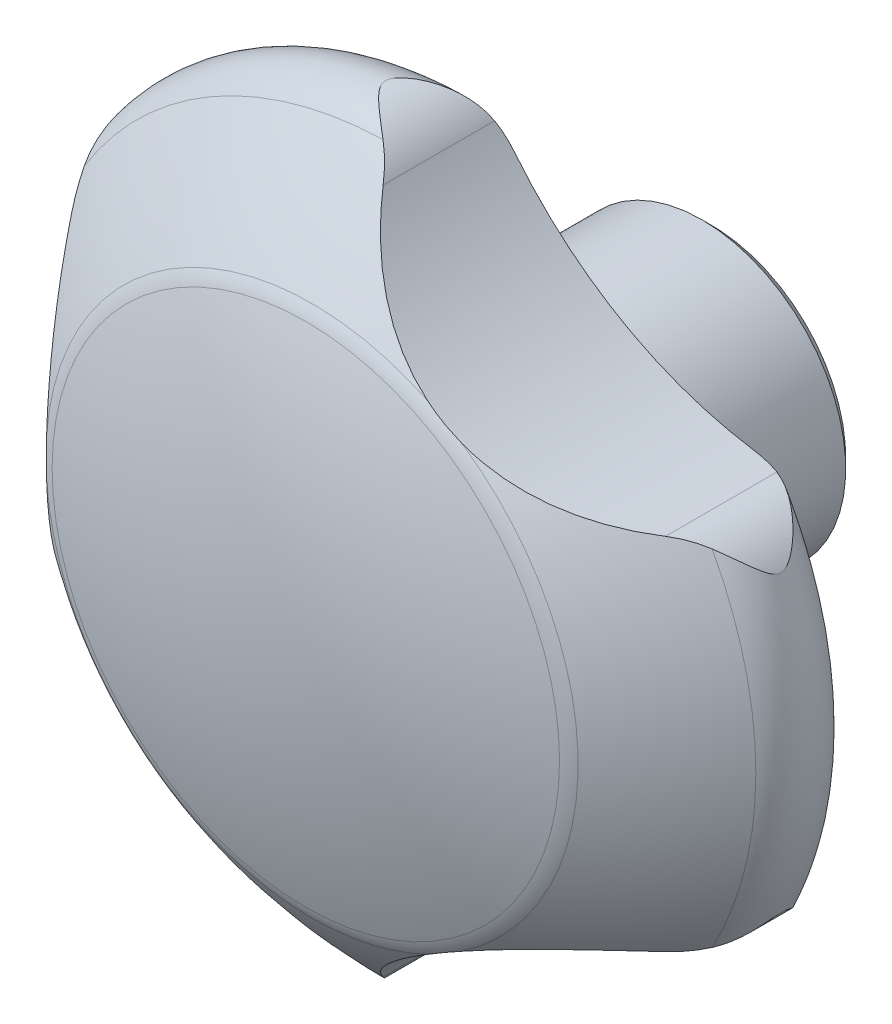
ISO-10303-21;
HEADER;
FILE_DESCRIPTION(('STEP AP214'),'2;1');
FILE_NAME('part.step','',(''),(''),'','','');
FILE_SCHEMA(('AUTOMOTIVE_DESIGN { 1 0 10303 214 1 1 1 1 }'));
ENDSEC;
DATA;
#1=APPLICATION_CONTEXT('core data for automotive mechanical design processes');
#2=APPLICATION_PROTOCOL_DEFINITION('international standard','automotive_design',2000,#1);
#3=PRODUCT_CONTEXT('',#1,'mechanical');
#4=PRODUCT('Part','Part','',(#3));
#5=PRODUCT_RELATED_PRODUCT_CATEGORY('part','',(#4));
#6=PRODUCT_DEFINITION_FORMATION('','',#4);
#7=PRODUCT_DEFINITION_CONTEXT('part definition',#1,'design');
#8=PRODUCT_DEFINITION('design','',#6,#7);
#9=PRODUCT_DEFINITION_SHAPE('','',#8);
#10=(LENGTH_UNIT() NAMED_UNIT(*) SI_UNIT(.MILLI.,.METRE.));
#11=(NAMED_UNIT(*) PLANE_ANGLE_UNIT() SI_UNIT($,.RADIAN.));
#12=(NAMED_UNIT(*) SI_UNIT($,.STERADIAN.) SOLID_ANGLE_UNIT());
#13=UNCERTAINTY_MEASURE_WITH_UNIT(LENGTH_MEASURE(1.E-05),#10,'distance_accuracy_value','');
#14=(GEOMETRIC_REPRESENTATION_CONTEXT(3) GLOBAL_UNCERTAINTY_ASSIGNED_CONTEXT((#13)) GLOBAL_UNIT_ASSIGNED_CONTEXT((#10,
#11,#12)) REPRESENTATION_CONTEXT('',''));
#15=CARTESIAN_POINT('',(0.,0.,0.));
#16=DIRECTION('',(0.,0.,1.));
#17=DIRECTION('',(1.,0.,0.));
#18=AXIS2_PLACEMENT_3D('',#15,#16,#17);
#19=CARTESIAN_POINT('',(0.,0.,18.75));
#20=DIRECTION('',(0.,0.,1.));
#21=DIRECTION('',(0.,-1.,0.));
#22=AXIS2_PLACEMENT_3D('',#19,#20,#21);
#23=TOROIDAL_SURFACE('',#22,21.25,3.75);
#24=CARTESIAN_POINT('',(0.,0.,15.));
#25=DIRECTION('',(0.,0.,1.));
#26=DIRECTION('',(0.,-1.,0.));
#27=AXIS2_PLACEMENT_3D('',#24,#25,#26);
#28=CIRCLE('',#27,21.25);
#29=CARTESIAN_POINT('',(-19.2095588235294,-9.0859974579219,15.));
#30=VERTEX_POINT('',#29);
#31=CARTESIAN_POINT('',(1.73607479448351,-21.1789646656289,15.));
#32=VERTEX_POINT('',#31);
#33=EDGE_CURVE('E344',#30,#32,#28,.T.);
#34=ORIENTED_EDGE('',*,*,#33,.T.);
#35=CARTESIAN_POINT('',(8.75,-15.1554445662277,18.75));
#36=CARTESIAN_POINT('',(8.7449848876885,-15.1583400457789,18.7465048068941));
#37=CARTESIAN_POINT('',(8.73997077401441,-15.1612372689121,18.743009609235));
#38=CARTESIAN_POINT('',(8.49931349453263,-15.3004037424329,18.5752211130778));
#39=CARTESIAN_POINT('',(8.26586854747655,-15.4405288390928,18.4109385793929));
#40=CARTESIAN_POINT('',(7.8026850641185,-15.7289792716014,18.0843487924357));
#41=CARTESIAN_POINT('',(7.57294663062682,-15.877304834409,17.9220415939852));
#42=CARTESIAN_POINT('',(7.11622865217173,-16.1829829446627,17.6011970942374));
#43=CARTESIAN_POINT('',(6.88925336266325,-16.3403476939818,17.4426653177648));
#44=CARTESIAN_POINT('',(6.43788004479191,-16.6646219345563,17.1318173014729));
#45=CARTESIAN_POINT('',(6.21348184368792,-16.8315307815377,16.979500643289));
#46=CARTESIAN_POINT('',(5.76758448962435,-17.1751404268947,16.684027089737));
#47=CARTESIAN_POINT('',(5.54607831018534,-17.3518078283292,16.5408421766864));
#48=CARTESIAN_POINT('',(5.10497579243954,-17.7162904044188,16.2659140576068));
#49=CARTESIAN_POINT('',(4.88537987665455,-17.9041079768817,16.1341733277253));
#50=CARTESIAN_POINT('',(4.44877375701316,-18.2911215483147,15.8858938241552));
#51=CARTESIAN_POINT('',(4.23175823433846,-18.4902859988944,15.7693156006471));
#52=CARTESIAN_POINT('',(3.80020306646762,-18.9009635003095,15.5550818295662));
#53=CARTESIAN_POINT('',(3.58566180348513,-19.1124678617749,15.4574131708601));
#54=CARTESIAN_POINT('',(3.23761695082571,-19.4685064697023,15.31725241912));
#55=CARTESIAN_POINT('',(3.1031337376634,-19.609287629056,15.2676363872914));
#56=CARTESIAN_POINT('',(2.83579563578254,-19.8958619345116,15.1795112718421));
#57=CARTESIAN_POINT('',(2.70294088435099,-20.0416554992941,15.1410031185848));
#58=CARTESIAN_POINT('',(2.43997889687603,-20.3372590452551,15.076937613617));
#59=CARTESIAN_POINT('',(2.30986170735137,-20.4870470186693,15.0513204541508));
#60=CARTESIAN_POINT('',(2.05236733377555,-20.7907586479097,15.0146179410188));
#61=CARTESIAN_POINT('',(1.92498993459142,-20.9446819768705,15.0035314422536));
#62=CARTESIAN_POINT('',(1.6971020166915,-21.2269042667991,14.9984199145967));
#63=CARTESIAN_POINT('',(1.5959883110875,-21.3546638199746,15.0016130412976));
#64=CARTESIAN_POINT('',(1.39673032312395,-21.6115378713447,15.020101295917));
#65=CARTESIAN_POINT('',(1.29858441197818,-21.7406515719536,15.035389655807));
#66=CARTESIAN_POINT('',(1.10471730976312,-22.0008735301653,15.0794596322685));
#67=CARTESIAN_POINT('',(1.00903821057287,-22.1319873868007,15.1083978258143));
#68=CARTESIAN_POINT('',(0.821945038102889,-22.3935585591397,15.1809641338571));
#69=CARTESIAN_POINT('',(0.730539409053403,-22.5240141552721,15.2246200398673));
#70=CARTESIAN_POINT('',(0.641765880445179,-22.653317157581,15.2761534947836));
#71=B_SPLINE_CURVE_WITH_KNOTS('',3,(#35,#36,#37,#38,#39,#40,#41,#42,#43,#44,#45,#46,#47,#48,#49,
#50,#51,#52,#53,#54,#55,#56,#57,#58,#59,#60,#61,#62,#63,#64,#65,#66,#67,#68,#69,#70),
.UNSPECIFIED.,.F.,.F.,(4,2,2,2,2,2,2,2,2,2,2,2,2,2,2,2,2,4),(0.,0.0202919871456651,
0.974127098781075,1.92798862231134,2.88316947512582,3.83828592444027,4.79031492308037,
5.74254939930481,6.6922545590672,7.64129885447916,8.24373030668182,8.84621220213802,
9.44587249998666,10.0454855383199,10.533943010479,11.0221273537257,11.5160531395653,
12.0109168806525),.UNSPECIFIED.);
#72=CARTESIAN_POINT('',(0.641903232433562,-22.653117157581,15.2760737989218));
#73=VERTEX_POINT('',#72);
#74=EDGE_CURVE('E248',#32,#73,#71,.T.);
#75=ORIENTED_EDGE('',*,*,#74,.T.);
#76=CARTESIAN_POINT('',(-0.666781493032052,-23.9562153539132,21.3362324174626));
#77=CARTESIAN_POINT('',(-0.779040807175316,-24.0326182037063,21.2527113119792));
#78=CARTESIAN_POINT('',(-0.893029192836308,-24.1034851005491,21.166546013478));
#79=CARTESIAN_POINT('',(-1.12332188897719,-24.2344319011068,20.9892190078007));
#80=CARTESIAN_POINT('',(-1.239626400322,-24.2945108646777,20.8980568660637));
#81=CARTESIAN_POINT('',(-1.47220267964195,-24.4035969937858,20.7119920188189));
#82=CARTESIAN_POINT('',(-1.58846279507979,-24.452710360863,20.6171366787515));
#83=CARTESIAN_POINT('',(-1.82073613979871,-24.540913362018,20.4226669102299));
#84=CARTESIAN_POINT('',(-1.93674944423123,-24.5800066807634,20.3230542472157));
#85=CARTESIAN_POINT('',(-2.13876860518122,-24.6402127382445,20.1429497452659));
#86=CARTESIAN_POINT('',(-2.22523948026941,-24.6633872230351,20.0636672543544));
#87=CARTESIAN_POINT('',(-2.39584370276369,-24.7044252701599,19.9005436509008));
#88=CARTESIAN_POINT('',(-2.47996510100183,-24.7222650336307,19.8166840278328));
#89=CARTESIAN_POINT('',(-2.64364796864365,-24.7528283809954,19.6421320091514));
#90=CARTESIAN_POINT('',(-2.72316471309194,-24.7655072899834,19.5513876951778));
#91=CARTESIAN_POINT('',(-2.83329888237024,-24.7807038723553,19.4080637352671));
#92=CARTESIAN_POINT('',(-2.86842549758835,-24.7851273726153,19.3591928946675));
#93=CARTESIAN_POINT('',(-2.93396075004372,-24.7927586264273,19.2583363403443));
#94=CARTESIAN_POINT('',(-2.96437822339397,-24.7959686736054,19.2063567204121));
#95=CARTESIAN_POINT('',(-3.0144821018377,-24.800888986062,19.1055183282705));
#96=CARTESIAN_POINT('',(-3.03504452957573,-24.8027388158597,19.0571145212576));
#97=CARTESIAN_POINT('',(-3.06800460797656,-24.8055734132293,18.9576248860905));
#98=CARTESIAN_POINT('',(-3.08043189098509,-24.8065613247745,18.9065495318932));
#99=CARTESIAN_POINT('',(-3.09365300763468,-24.8076017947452,18.8111290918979));
#100=CARTESIAN_POINT('',(-3.09598202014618,-24.8077780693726,18.7670046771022));
#101=CARTESIAN_POINT('',(-3.09282879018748,-24.8075341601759,18.6790329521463));
#102=CARTESIAN_POINT('',(-3.08734310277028,-24.8071137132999,18.6351857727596));
#103=CARTESIAN_POINT('',(-3.06687973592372,-24.8054649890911,18.5365627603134));
#104=CARTESIAN_POINT('',(-3.04962269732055,-24.8040388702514,18.4822778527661));
#105=CARTESIAN_POINT('',(-3.00692868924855,-24.8001673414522,18.3770209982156));
#106=CARTESIAN_POINT('',(-2.9814597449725,-24.7977179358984,18.3260629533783));
#107=CARTESIAN_POINT('',(-2.91562430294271,-24.790746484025,18.2104467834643));
#108=CARTESIAN_POINT('',(-2.87314027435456,-24.7858023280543,18.1470507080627));
#109=CARTESIAN_POINT('',(-2.78269141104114,-24.7739141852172,18.0244336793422));
#110=CARTESIAN_POINT('',(-2.73471407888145,-24.7669655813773,17.9652227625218));
#111=CARTESIAN_POINT('',(-2.63518542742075,-24.7509448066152,17.8495922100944));
#112=CARTESIAN_POINT('',(-2.5836143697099,-24.7418601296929,17.7931914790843));
#113=CARTESIAN_POINT('',(-2.47843898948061,-24.7215369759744,17.6828562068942));
#114=CARTESIAN_POINT('',(-2.42483664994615,-24.7103005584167,17.6289193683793));
#115=CARTESIAN_POINT('',(-2.24976068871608,-24.6704624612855,17.4578595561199));
#116=CARTESIAN_POINT('',(-2.12569217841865,-24.6374676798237,17.3443925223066));
#117=CARTESIAN_POINT('',(-1.87541516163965,-24.5599799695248,17.1237678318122));
#118=CARTESIAN_POINT('',(-1.74920468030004,-24.5154758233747,17.0166164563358));
#119=CARTESIAN_POINT('',(-1.49721992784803,-24.4147000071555,16.8080924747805));
#120=CARTESIAN_POINT('',(-1.37144532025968,-24.3584555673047,16.7067071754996));
#121=CARTESIAN_POINT('',(-1.12172304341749,-24.2337992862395,16.5094230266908));
#122=CARTESIAN_POINT('',(-0.997774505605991,-24.165393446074,16.4135215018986));
#123=CARTESIAN_POINT('',(-0.771458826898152,-24.0273046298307,16.2415959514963));
#124=CARTESIAN_POINT('',(-0.668650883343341,-23.9593628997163,16.1647524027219));
#125=CARTESIAN_POINT('',(-0.466126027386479,-23.8142404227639,16.0157740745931));
#126=CARTESIAN_POINT('',(-0.366409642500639,-23.737058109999,15.9436400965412));
#127=CARTESIAN_POINT('',(-0.171252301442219,-23.5735548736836,15.8049600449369));
#128=CARTESIAN_POINT('',(-0.0758000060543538,-23.4872605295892,15.7383986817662));
#129=CARTESIAN_POINT('',(0.110160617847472,-23.305296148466,15.6114916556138));
#130=CARTESIAN_POINT('',(0.200670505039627,-23.2096290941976,15.5511440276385));
#131=CARTESIAN_POINT('',(0.350451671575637,-23.0379232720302,15.45406051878));
#132=CARTESIAN_POINT('',(0.411203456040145,-22.9641817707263,15.4155347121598));
#133=CARTESIAN_POINT('',(0.529292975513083,-22.8120278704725,15.3425770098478));
#134=CARTESIAN_POINT('',(0.586629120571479,-22.733613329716,15.3081470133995));
#135=CARTESIAN_POINT('',(0.642040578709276,-22.652917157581,15.2759941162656));
#136=B_SPLINE_CURVE_WITH_KNOTS('',3,(#76,#77,#78,#79,#80,#81,#82,#83,#84,#85,#86,#87,#88,#89,
#90,#91,#92,#93,#94,#95,#96,#97,#98,#99,#100,#101,#102,#103,#104,#105,#106,#107,#108,#109,#110,
#111,#112,#113,#114,#115,#116,#117,#118,#119,#120,#121,#122,#123,#124,#125,#126,#127,#128,#129,
#130,#131,#132,#133,#134,#135),.UNSPECIFIED.,.F.,.F.,(4,2,2,2,2,2,2,2,2,2,2,2,2,2,2,2,2,2,2,2,2,
2,2,2,2,2,2,2,2,4),(0.,0.478066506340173,0.956174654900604,1.42942941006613,1.90250988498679,
2.26105820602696,2.62118297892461,2.98436206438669,3.16522841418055,3.34575116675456,
3.50311745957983,3.65990730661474,3.79177502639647,3.92370089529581,4.09363538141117,
4.26423970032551,4.49308748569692,4.72246665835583,4.95322376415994,5.18376112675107,
5.69710734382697,6.21095577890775,6.72362538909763,7.23604272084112,7.67134997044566,
8.10673109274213,8.54087558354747,8.97488235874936,9.28370938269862,9.59267905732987),.UNSPECIFIED.);
#137=CARTESIAN_POINT('',(-0.667050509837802,-23.9563984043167,21.3360324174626));
#138=VERTEX_POINT('',#137);
#139=EDGE_CURVE('E266',#138,#73,#136,.T.);
#140=ORIENTED_EDGE('',*,*,#139,.F.);
#141=CARTESIAN_POINT('',(0.,0.,21.3360324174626));
#142=DIRECTION('',(0.,0.,1.));
#143=DIRECTION('',(0.,-1.,0.));
#144=AXIS2_PLACEMENT_3D('',#141,#142,#143);
#145=CIRCLE('',#144,23.9656834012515);
#146=CARTESIAN_POINT('',(-20.4133243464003,-12.5558818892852,21.3360324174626));
#147=VERTEX_POINT('',#146);
#148=EDGE_CURVE('E357',#147,#138,#145,.T.);
#149=ORIENTED_EDGE('',*,*,#148,.F.);
#150=CARTESIAN_POINT('',(-19.939031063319,-10.7704540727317,15.2760010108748));
#151=CARTESIAN_POINT('',(-20.0050283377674,-10.9086558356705,15.3263308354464));
#152=CARTESIAN_POINT('',(-20.0638003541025,-11.0480982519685,15.3821742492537));
#153=CARTESIAN_POINT('',(-20.1673827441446,-11.3277657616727,15.5031978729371));
#154=CARTESIAN_POINT('',(-20.2122212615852,-11.4679886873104,15.5683588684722));
#155=CARTESIAN_POINT('',(-20.2885179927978,-11.7474655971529,15.7062356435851));
#156=CARTESIAN_POINT('',(-20.320035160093,-11.8867211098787,15.7789163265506));
#157=CARTESIAN_POINT('',(-20.3707269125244,-12.1638995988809,15.9309548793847));
#158=CARTESIAN_POINT('',(-20.3898943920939,-12.3018217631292,16.0103165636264));
#159=CARTESIAN_POINT('',(-20.41824038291,-12.5919434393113,16.1847706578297));
#160=CARTESIAN_POINT('',(-20.4259231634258,-12.7438427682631,16.2806030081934));
#161=CARTESIAN_POINT('',(-20.427787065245,-13.043519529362,16.4786223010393));
#162=CARTESIAN_POINT('',(-20.4219661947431,-13.1912963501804,16.580810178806));
#163=CARTESIAN_POINT('',(-20.3980121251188,-13.4812904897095,16.7910102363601));
#164=CARTESIAN_POINT('',(-20.3798953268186,-13.6235149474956,16.8990144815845));
#165=CARTESIAN_POINT('',(-20.3327283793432,-13.9010593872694,17.1211871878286));
#166=CARTESIAN_POINT('',(-20.3036846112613,-14.0363833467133,17.2353520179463));
#167=CARTESIAN_POINT('',(-20.2487068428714,-14.2507406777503,17.4290773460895));
#168=CARTESIAN_POINT('',(-20.2254029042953,-14.3325341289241,17.5063383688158));
#169=CARTESIAN_POINT('',(-20.1759550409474,-14.4912780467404,17.6653563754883));
#170=CARTESIAN_POINT('',(-20.1498022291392,-14.5682121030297,17.7471270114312));
#171=CARTESIAN_POINT('',(-20.0959194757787,-14.715561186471,17.9178762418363));
#172=CARTESIAN_POINT('',(-20.0681749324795,-14.7858917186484,18.0069264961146));
#173=CARTESIAN_POINT('',(-20.0285289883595,-14.8809777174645,18.1478405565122));
#174=CARTESIAN_POINT('',(-20.0156706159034,-14.9108788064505,18.1959111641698));
#175=CARTESIAN_POINT('',(-19.9915548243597,-14.9656875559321,18.2951518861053));
#176=CARTESIAN_POINT('',(-19.9802939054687,-14.9906061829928,18.3463148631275));
#177=CARTESIAN_POINT('',(-19.9620564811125,-15.0303117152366,18.4451176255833));
#178=CARTESIAN_POINT('',(-19.9547077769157,-15.0460096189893,18.4923085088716));
#179=CARTESIAN_POINT('',(-19.9434458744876,-15.0698868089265,18.5888820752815));
#180=CARTESIAN_POINT('',(-19.9395203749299,-15.0780930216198,18.6382562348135));
#181=CARTESIAN_POINT('',(-19.9359663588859,-15.0855282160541,18.7383503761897));
#182=CARTESIAN_POINT('',(-19.9363784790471,-15.0846722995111,18.7890786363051));
#183=CARTESIAN_POINT('',(-19.9414927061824,-15.0739589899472,18.889382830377));
#184=CARTESIAN_POINT('',(-19.9462039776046,-15.064082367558,18.9389560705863));
#185=CARTESIAN_POINT('',(-19.9607791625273,-15.0330474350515,19.0502572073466));
#186=CARTESIAN_POINT('',(-19.971774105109,-15.0093721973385,19.1110985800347));
#187=CARTESIAN_POINT('',(-19.9967550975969,-14.9540281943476,19.2284300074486));
#188=CARTESIAN_POINT('',(-20.0107539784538,-14.9223250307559,19.2848999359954));
#189=CARTESIAN_POINT('',(-20.048100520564,-14.8348377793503,19.4245424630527));
#190=CARTESIAN_POINT('',(-20.0723291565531,-14.7754462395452,19.505166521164));
#191=CARTESIAN_POINT('',(-20.1205404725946,-14.6495558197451,19.6608254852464));
#192=CARTESIAN_POINT('',(-20.1445224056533,-14.583039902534,19.7358462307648));
#193=CARTESIAN_POINT('',(-20.1908743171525,-14.4447826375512,19.8823943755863));
#194=CARTESIAN_POINT('',(-20.2132328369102,-14.3730102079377,19.9538959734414));
#195=CARTESIAN_POINT('',(-20.2552915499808,-14.2259357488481,20.0938014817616));
#196=CARTESIAN_POINT('',(-20.2749943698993,-14.1506373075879,20.1622084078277));
#197=CARTESIAN_POINT('',(-20.3209136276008,-13.9561680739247,20.3324653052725));
#198=CARTESIAN_POINT('',(-20.34499093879,-13.8350387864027,20.4326698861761));
#199=CARTESIAN_POINT('',(-20.3844246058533,-13.5875110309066,20.6282828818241));
#200=CARTESIAN_POINT('',(-20.3997763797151,-13.4611098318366,20.723688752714));
#201=CARTESIAN_POINT('',(-20.4206049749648,-13.2065858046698,20.9080353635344));
#202=CARTESIAN_POINT('',(-20.4262663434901,-13.0785430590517,20.99706524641));
#203=CARTESIAN_POINT('',(-20.4275210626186,-12.8192577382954,21.1703181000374));
#204=CARTESIAN_POINT('',(-20.4231172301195,-12.6880160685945,21.2545424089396));
#205=CARTESIAN_POINT('',(-20.4133003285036,-12.5555573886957,21.3362324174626));
#206=B_SPLINE_CURVE_WITH_KNOTS('',3,(#150,#151,#152,#153,#154,#155,#156,#157,#158,#159,#160,
#161,#162,#163,#164,#165,#166,#167,#168,#169,#170,#171,#172,#173,#174,#175,#176,#177,#178,#179,
#180,#181,#182,#183,#184,#185,#186,#187,#188,#189,#190,#191,#192,#193,#194,#195,#196,#197,#198,
#199,#200,#201,#202,#203,#204,#205),.UNSPECIFIED.,.F.,.F.,(4,2,2,2,2,2,2,2,2,2,2,2,2,2,2,2,2,2,
2,2,2,2,2,2,2,2,2,4),(0.,0.483118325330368,0.965254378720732,1.44523381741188,1.92548917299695,
2.46406656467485,3.00272340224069,3.54066316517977,4.07828927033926,4.42280829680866,
4.76843461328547,5.11800857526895,5.2919641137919,5.46553245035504,5.61580302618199,
5.76553135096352,5.91666363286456,6.06811883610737,6.26561792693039,6.46397802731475,
6.772286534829,7.08134952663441,7.39241624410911,7.70317300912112,8.17985294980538,
8.65678297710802,9.12452475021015,9.59213563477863),.UNSPECIFIED.);
#207=CARTESIAN_POINT('',(-19.9391265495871,-10.7706540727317,15.2760737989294));
#208=VERTEX_POINT('',#207);
#209=EDGE_CURVE('E198',#208,#147,#206,.T.);
#210=ORIENTED_EDGE('',*,*,#209,.F.);
#211=CARTESIAN_POINT('',(-17.5,0.,18.75));
#212=CARTESIAN_POINT('',(-17.5000000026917,-0.00579095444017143,18.7465048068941));
#213=CARTESIAN_POINT('',(-17.5000020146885,-0.0115819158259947,18.743009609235));
#214=CARTESIAN_POINT('',(-17.5001950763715,-0.289580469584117,18.5752211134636));
#215=CARTESIAN_POINT('',(-17.5048244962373,-0.561812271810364,18.4109385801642));
#216=CARTESIAN_POINT('',(-17.5230381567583,-1.10716614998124,18.0843487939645));
#217=CARTESIAN_POINT('',(-17.5366226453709,-1.380288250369,17.9220415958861));
#218=CARTESIAN_POINT('',(-17.5729886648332,-1.92865667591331,17.6011970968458));
#219=CARTESIAN_POINT('',(-17.5957828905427,-2.20390541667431,17.4426653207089));
#220=CARTESIAN_POINT('',(-17.6509259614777,-2.75694329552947,17.1318173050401));
#221=CARTESIAN_POINT('',(-17.6832741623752,-3.03473226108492,16.9795006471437));
#222=CARTESIAN_POINT('',(-17.7579001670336,-3.59269551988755,16.6840270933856));
#223=CARTESIAN_POINT('',(-17.8001455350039,-3.87285919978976,16.5408421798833));
#224=CARTESIAN_POINT('',(-17.8952454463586,-4.43710647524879,16.2659140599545));
#225=CARTESIAN_POINT('',(-17.9481022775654,-4.72119090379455,16.1341733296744));
#226=CARTESIAN_POINT('',(-18.0649628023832,-5.29280968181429,15.8858938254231));
#227=CARTESIAN_POINT('',(-18.1289365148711,-5.58033286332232,15.7693156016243));
#228=CARTESIAN_POINT('',(-18.268816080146,-6.15940935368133,15.5550818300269));
#229=CARTESIAN_POINT('',(-18.3447135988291,-6.45095971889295,15.4574131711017));
#230=CARTESIAN_POINT('',(-18.4790297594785,-6.93039509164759,15.3172523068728));
#231=CARTESIAN_POINT('',(-18.5337083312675,-7.11725193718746,15.2676361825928));
#232=CARTESIAN_POINT('',(-18.648220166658,-7.49206145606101,15.1795109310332));
#233=CARTESIAN_POINT('',(-18.7080538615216,-7.68001421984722,15.1410027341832));
#234=CARTESIAN_POINT('',(-18.8325733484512,-8.05554853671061,15.0769372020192));
#235=CARTESIAN_POINT('',(-18.8972351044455,-8.24312770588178,15.0513200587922));
#236=CARTESIAN_POINT('',(-19.0315102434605,-8.61798096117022,15.014617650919));
#237=CARTESIAN_POINT('',(-19.1011232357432,-8.8052550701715,15.0035312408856));
#238=CARTESIAN_POINT('',(-19.2315903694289,-9.14372123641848,14.9984199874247));
#239=CARTESIAN_POINT('',(-19.2916757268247,-9.29516598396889,15.0016131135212));
#240=CARTESIAN_POINT('',(-19.4145044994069,-9.59616141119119,15.0201010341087));
#241=CARTESIAN_POINT('',(-19.4772464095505,-9.74571310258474,15.035389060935));
#242=CARTESIAN_POINT('',(-19.6056698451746,-10.0437139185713,15.0794579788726));
#243=CARTESIAN_POINT('',(-19.6713772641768,-10.1921293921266,15.1083954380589));
#244=CARTESIAN_POINT('',(-19.8043560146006,-10.4849385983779,15.1809598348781));
#245=CARTESIAN_POINT('',(-19.8716300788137,-10.629324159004,15.2246145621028));
#246=CARTESIAN_POINT('',(-19.9392220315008,-10.7708540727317,15.2761465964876));
#247=B_SPLINE_CURVE_WITH_KNOTS('',3,(#211,#212,#213,#214,#215,#216,#217,#218,#219,#220,#221,
#222,#223,#224,#225,#226,#227,#228,#229,#230,#231,#232,#233,#234,#235,#236,#237,#238,#239,#240,
#241,#242,#243,#244,#245,#246),.UNSPECIFIED.,.F.,.F.,(4,2,2,2,2,2,2,2,2,2,2,2,2,2,2,2,2,4),(0.,
0.0202919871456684,0.974127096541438,1.92798861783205,2.88316946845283,3.83828591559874,
4.79031491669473,5.74254939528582,6.69225455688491,7.64129885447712,8.24373154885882,
8.84621468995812,9.4458762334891,10.045490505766,10.5339413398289,11.0221190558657,
11.5160379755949,12.0108948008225),.UNSPECIFIED.);
#248=EDGE_CURVE('E138',#208,#30,#247,.F.);
#249=ORIENTED_EDGE('',*,*,#248,.T.);
#250=EDGE_LOOP('',(#34,#75,#140,#149,#210,#249));
#251=FACE_BOUND('',#250,.T.);
#252=ADVANCED_FACE('F14',(#251),#23,.T.);
#253=CARTESIAN_POINT('',(0.64204057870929,22.652917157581,15.2759941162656));
#254=CARTESIAN_POINT('',(0.555353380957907,22.7791739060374,15.326323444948));
#255=CARTESIAN_POINT('',(0.463979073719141,22.8997937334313,15.3821664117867));
#256=CARTESIAN_POINT('',(0.273571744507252,23.1293335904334,15.5031892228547));
#257=CARTESIAN_POINT('',(0.17455467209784,23.2382769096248,15.5683498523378));
#258=CARTESIAN_POINT('',(-0.0293305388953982,23.4440913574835,15.7062259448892));
#259=CARTESIAN_POINT('',(-0.134170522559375,23.5410143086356,15.7789063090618));
#260=CARTESIAN_POINT('',(-0.348867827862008,23.7235049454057,15.9309442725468));
#261=CARTESIAN_POINT('',(-0.458727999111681,23.8090660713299,16.0103056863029));
#262=CARTESIAN_POINT('',(-0.695807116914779,23.9786761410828,16.1847590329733));
#263=CARTESIAN_POINT('',(-0.823513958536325,24.0612796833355,16.2805908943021));
#264=CARTESIAN_POINT('',(-1.08210885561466,24.2127330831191,16.478609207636));
#265=CARTESIAN_POINT('',(-1.21299737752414,24.2815809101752,16.5807965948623));
#266=CARTESIAN_POINT('',(-1.47611600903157,24.4058340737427,16.7909956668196));
#267=CARTESIAN_POINT('',(-1.60834410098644,24.4612571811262,16.8989994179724));
#268=CARTESIAN_POINT('',(-1.87228762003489,24.5591826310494,17.1211710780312));
#269=CARTESIAN_POINT('',(-2.00400330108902,24.6016924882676,17.2353353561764));
#270=CARTESIAN_POINT('',(-2.21713195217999,24.6612601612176,17.429060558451));
#271=CARTESIAN_POINT('',(-2.29962010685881,24.6819756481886,17.5063220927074));
#272=CARTESIAN_POINT('',(-2.46182231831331,24.7185255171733,17.6653410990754));
#273=CARTESIAN_POINT('',(-2.54152660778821,24.7343439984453,17.747112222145));
#274=CARTESIAN_POINT('',(-2.69607819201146,24.7613555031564,17.9178623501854));
#275=CARTESIAN_POINT('',(-2.77085961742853,24.7724936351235,18.0069130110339));
#276=CARTESIAN_POINT('',(-2.87303137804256,24.7857026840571,18.1478276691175));
#277=CARTESIAN_POINT('',(-2.90535633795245,24.789517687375,18.1958984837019));
#278=CARTESIAN_POINT('',(-2.96488143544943,24.7960374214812,18.2951396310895));
#279=CARTESIAN_POINT('',(-2.99209281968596,24.7987446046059,18.3463028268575));
#280=CARTESIAN_POINT('',(-3.03559903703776,24.8028034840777,18.445106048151));
#281=CARTESIAN_POINT('',(-3.05286890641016,24.8042883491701,18.492297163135));
#282=CARTESIAN_POINT('',(-3.07917959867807,24.8064739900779,18.5888712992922));
#283=CARTESIAN_POINT('',(-3.0882498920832,24.8071775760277,18.6382457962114));
#284=CARTESIAN_POINT('',(-3.09646736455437,24.8078174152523,18.7383408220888));
#285=CARTESIAN_POINT('',(-3.09552068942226,24.8077464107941,18.7890696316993));
#286=CARTESIAN_POINT('',(-3.08368654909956,24.8068188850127,18.8893749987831));
#287=CARTESIAN_POINT('',(-3.07277784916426,24.8059606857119,18.938948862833));
#288=CARTESIAN_POINT('',(-3.03861415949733,24.8030657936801,19.0502498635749));
#289=CARTESIAN_POINT('',(-3.0126141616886,24.8007501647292,19.1110905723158));
#290=CARTESIAN_POINT('',(-2.95219604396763,24.7947125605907,19.2284207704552));
#291=CARTESIAN_POINT('',(-2.91774171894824,24.7909844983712,19.2848901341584));
#292=CARTESIAN_POINT('',(-2.82330501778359,24.7795843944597,19.4245304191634));
#293=CARTESIAN_POINT('',(-2.75975811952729,24.7708716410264,19.5051529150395));
#294=CARTESIAN_POINT('',(-2.62663219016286,24.7496796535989,19.66080887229));
#295=CARTESIAN_POINT('',(-2.55703877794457,24.7371912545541,19.7358281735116));
#296=CARTESIAN_POINT('',(-2.41413255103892,24.7082059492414,19.8823735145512));
#297=CARTESIAN_POINT('',(-2.34079854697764,24.6916835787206,19.9538737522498));
#298=CARTESIAN_POINT('',(-2.19240293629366,24.6545720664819,20.093776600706));
#299=CARTESIAN_POINT('',(-2.11734312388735,24.6339869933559,20.162182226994));
#300=CARTESIAN_POINT('',(-1.92596765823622,24.5765208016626,20.332440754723));
#301=CARTESIAN_POINT('',(-1.80902532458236,24.5368075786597,20.4326480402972));
#302=CARTESIAN_POINT('',(-1.574937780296,24.4471935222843,20.6282662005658));
#303=CARTESIAN_POINT('',(-1.45779249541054,24.397287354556,20.7236745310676));
#304=CARTESIAN_POINT('',(-1.22694864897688,24.2880618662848,20.908025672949));
#305=CARTESIAN_POINT('',(-1.11322716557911,24.2289424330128,20.9970576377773));
#306=CARTESIAN_POINT('',(-0.888047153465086,24.1003840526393,21.1703144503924));
#307=CARTESIAN_POINT('',(-0.77658800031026,24.0309479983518,21.2545406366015));
#308=CARTESIAN_POINT('',(-0.666781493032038,23.9562153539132,21.3362324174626));
#309=B_SPLINE_CURVE_WITH_KNOTS('',3,(#253,#254,#255,#256,#257,#258,#259,#260,#261,#262,#263,
#264,#265,#266,#267,#268,#269,#270,#271,#272,#273,#274,#275,#276,#277,#278,#279,#280,#281,#282,
#283,#284,#285,#286,#287,#288,#289,#290,#291,#292,#293,#294,#295,#296,#297,#298,#299,#300,#301,
#302,#303,#304,#305,#306,#307,#308),.UNSPECIFIED.,.F.,.F.,(4,2,2,2,2,2,2,2,2,2,2,2,2,2,2,2,2,2,
2,2,2,2,2,2,2,2,2,4),(0.,0.483118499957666,0.965254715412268,1.44523419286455,1.92548959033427,
2.46406579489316,3.00272143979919,3.54066009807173,4.07828510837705,4.42280757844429,
4.76843726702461,5.11801444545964,5.29197165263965,5.46554166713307,5.61581366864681,
5.76554339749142,5.91667725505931,6.06813401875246,6.26563030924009,6.46398759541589,
6.77228864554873,7.08134416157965,7.39240344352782,7.70315278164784,8.17984372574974,
8.65678478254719,9.12453669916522,9.59215770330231),.UNSPECIFIED.);
#310=CARTESIAN_POINT('',(0.641903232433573,22.653117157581,15.2760737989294));
#311=VERTEX_POINT('',#310);
#312=CARTESIAN_POINT('',(-0.667050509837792,23.9563984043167,21.3360324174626));
#313=VERTEX_POINT('',#312);
#314=EDGE_CURVE('E286',#311,#313,#309,.T.);
#315=ORIENTED_EDGE('',*,*,#314,.F.);
#316=CARTESIAN_POINT('',(8.75,15.1554445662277,18.75));
#317=CARTESIAN_POINT('',(8.74498488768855,15.1583400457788,18.746504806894));
#318=CARTESIAN_POINT('',(8.73997077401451,15.161237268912,18.7430096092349));
#319=CARTESIAN_POINT('',(8.49931349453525,15.3004037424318,18.575221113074));
#320=CARTESIAN_POINT('',(8.26586854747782,15.4405288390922,18.4109385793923));
#321=CARTESIAN_POINT('',(7.80268506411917,15.7289792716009,18.0843487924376));
#322=CARTESIAN_POINT('',(7.57294663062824,15.877304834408,17.9220415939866));
#323=CARTESIAN_POINT('',(7.11622865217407,16.1829829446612,17.6011970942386));
#324=CARTESIAN_POINT('',(6.88925336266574,16.3403476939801,17.4426653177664));
#325=CARTESIAN_POINT('',(6.43788004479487,16.6646219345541,17.1318173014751));
#326=CARTESIAN_POINT('',(6.2134818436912,16.8315307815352,16.9795006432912));
#327=CARTESIAN_POINT('',(5.76758448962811,17.1751404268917,16.6840270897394));
#328=CARTESIAN_POINT('',(5.54607831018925,17.351807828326,16.5408421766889));
#329=CARTESIAN_POINT('',(5.10497579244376,17.7162904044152,16.2659140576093));
#330=CARTESIAN_POINT('',(4.88537987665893,17.9041079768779,16.1341733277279));
#331=CARTESIAN_POINT('',(4.4487737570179,18.2911215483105,15.8858938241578));
#332=CARTESIAN_POINT('',(4.2317582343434,18.4902859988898,15.7693156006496));
#333=CARTESIAN_POINT('',(3.80020306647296,18.9009635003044,15.5550818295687));
#334=CARTESIAN_POINT('',(3.58566180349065,19.1124678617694,15.4574131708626));
#335=CARTESIAN_POINT('',(3.23761695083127,19.4685064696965,15.3172524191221));
#336=CARTESIAN_POINT('',(3.10313373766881,19.6092876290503,15.2676363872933));
#337=CARTESIAN_POINT('',(2.83579563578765,19.895861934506,15.1795112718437));
#338=CARTESIAN_POINT('',(2.70294088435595,20.0416554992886,15.1410031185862));
#339=CARTESIAN_POINT('',(2.43997889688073,20.3372590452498,15.076937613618));
#340=CARTESIAN_POINT('',(2.30986170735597,20.487047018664,15.0513204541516));
#341=CARTESIAN_POINT('',(2.05236733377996,20.7907586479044,15.0146179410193));
#342=CARTESIAN_POINT('',(1.92498993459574,20.9446819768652,15.0035314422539));
#343=CARTESIAN_POINT('',(1.69710201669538,21.2269042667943,14.9984199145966));
#344=CARTESIAN_POINT('',(1.59598831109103,21.3546638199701,15.0016130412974));
#345=CARTESIAN_POINT('',(1.39673032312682,21.6115378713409,15.0201012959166));
#346=CARTESIAN_POINT('',(1.29858441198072,21.7406515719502,15.0353896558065));
#347=CARTESIAN_POINT('',(1.10471730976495,22.0008735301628,15.079459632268));
#348=CARTESIAN_POINT('',(1.00903821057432,22.1319873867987,15.1083978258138));
#349=CARTESIAN_POINT('',(0.821945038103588,22.3935585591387,15.1809641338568));
#350=CARTESIAN_POINT('',(0.730539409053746,22.5240141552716,15.2246200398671));
#351=CARTESIAN_POINT('',(0.641765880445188,22.653317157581,15.2761534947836));
#352=B_SPLINE_CURVE_WITH_KNOTS('',3,(#316,#317,#318,#319,#320,#321,#322,#323,#324,#325,#326,
#327,#328,#329,#330,#331,#332,#333,#334,#335,#336,#337,#338,#339,#340,#341,#342,#343,#344,#345,
#346,#347,#348,#349,#350,#351),.UNSPECIFIED.,.F.,.F.,(4,2,2,2,2,2,2,2,2,2,2,2,2,2,2,2,2,4),(0.,
0.0202919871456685,0.974127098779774,1.92798862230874,2.883169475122,3.83828592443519,
4.79031492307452,5.74254939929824,6.6922545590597,7.64129885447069,8.24373030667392,
8.84621220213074,9.44587249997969,10.0454855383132,10.5339430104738,11.022127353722,
11.5160531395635,12.0109168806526),.UNSPECIFIED.);
#353=CARTESIAN_POINT('',(1.73607479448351,21.1789646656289,15.));
#354=VERTEX_POINT('',#353);
#355=EDGE_CURVE('E256',#311,#354,#352,.F.);
#356=ORIENTED_EDGE('',*,*,#355,.T.);
#357=CARTESIAN_POINT('',(-19.2095588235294,9.08599745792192,15.));
#358=VERTEX_POINT('',#357);
#359=EDGE_CURVE('E350',#354,#358,#28,.T.);
#360=ORIENTED_EDGE('',*,*,#359,.T.);
#361=CARTESIAN_POINT('',(-17.5,0.,18.75));
#362=CARTESIAN_POINT('',(-17.5000000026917,0.00579095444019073,18.7465048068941));
#363=CARTESIAN_POINT('',(-17.5000020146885,0.011581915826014,18.743009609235));
#364=CARTESIAN_POINT('',(-17.5001950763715,0.289580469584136,18.5752211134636));
#365=CARTESIAN_POINT('',(-17.5048244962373,0.561812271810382,18.4109385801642));
#366=CARTESIAN_POINT('',(-17.5230381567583,1.10716614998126,18.0843487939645));
#367=CARTESIAN_POINT('',(-17.5366226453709,1.38028825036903,17.9220415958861));
#368=CARTESIAN_POINT('',(-17.5729886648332,1.92865667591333,17.6011970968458));
#369=CARTESIAN_POINT('',(-17.5957828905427,2.20390541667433,17.4426653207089));
#370=CARTESIAN_POINT('',(-17.6509259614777,2.75694329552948,17.1318173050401));
#371=CARTESIAN_POINT('',(-17.6832741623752,3.03473226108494,16.9795006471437));
#372=CARTESIAN_POINT('',(-17.7579001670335,3.59269551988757,16.6840270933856));
#373=CARTESIAN_POINT('',(-17.8001455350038,3.87285919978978,16.5408421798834));
#374=CARTESIAN_POINT('',(-17.8952454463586,4.43710647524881,16.2659140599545));
#375=CARTESIAN_POINT('',(-17.9481022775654,4.72119090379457,16.1341733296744));
#376=CARTESIAN_POINT('',(-18.0649628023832,5.2928096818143,15.8858938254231));
#377=CARTESIAN_POINT('',(-18.128936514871,5.58033286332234,15.7693156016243));
#378=CARTESIAN_POINT('',(-18.268816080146,6.15940935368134,15.5550818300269));
#379=CARTESIAN_POINT('',(-18.3447135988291,6.45095971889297,15.4574131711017));
#380=CARTESIAN_POINT('',(-18.4790297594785,6.93039509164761,15.3172523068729));
#381=CARTESIAN_POINT('',(-18.5337083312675,7.11725193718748,15.2676361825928));
#382=CARTESIAN_POINT('',(-18.648220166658,7.49206145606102,15.1795109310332));
#383=CARTESIAN_POINT('',(-18.7080538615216,7.68001421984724,15.1410027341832));
#384=CARTESIAN_POINT('',(-18.8325733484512,8.05554853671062,15.0769372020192));
#385=CARTESIAN_POINT('',(-18.8972351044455,8.24312770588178,15.0513200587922));
#386=CARTESIAN_POINT('',(-19.0315102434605,8.61798096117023,15.014617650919));
#387=CARTESIAN_POINT('',(-19.1011232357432,8.80525507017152,15.0035312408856));
#388=CARTESIAN_POINT('',(-19.2315903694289,9.14372123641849,14.9984199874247));
#389=CARTESIAN_POINT('',(-19.2916757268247,9.29516598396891,15.0016131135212));
#390=CARTESIAN_POINT('',(-19.4145044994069,9.5961614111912,15.0201010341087));
#391=CARTESIAN_POINT('',(-19.4772464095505,9.74571310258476,15.035389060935));
#392=CARTESIAN_POINT('',(-19.6056698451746,10.0437139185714,15.0794579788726));
#393=CARTESIAN_POINT('',(-19.6713772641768,10.1921293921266,15.1083954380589));
#394=CARTESIAN_POINT('',(-19.8043560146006,10.4849385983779,15.1809598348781));
#395=CARTESIAN_POINT('',(-19.8716300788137,10.629324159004,15.2246145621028));
#396=CARTESIAN_POINT('',(-19.9392220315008,10.7708540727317,15.2761465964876));
#397=B_SPLINE_CURVE_WITH_KNOTS('',3,(#361,#362,#363,#364,#365,#366,#367,#368,#369,#370,#371,
#372,#373,#374,#375,#376,#377,#378,#379,#380,#381,#382,#383,#384,#385,#386,#387,#388,#389,#390,
#391,#392,#393,#394,#395,#396),.UNSPECIFIED.,.F.,.F.,(4,2,2,2,2,2,2,2,2,2,2,2,2,2,2,2,2,4),(0.,
0.0202919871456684,0.974127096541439,1.92798861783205,2.88316946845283,3.83828591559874,
4.79031491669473,5.74254939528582,6.69225455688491,7.64129885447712,8.24373154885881,
8.84621468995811,9.44587623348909,10.0454905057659,10.5339413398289,11.0221190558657,
11.5160379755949,12.0108948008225),.UNSPECIFIED.);
#398=CARTESIAN_POINT('',(-19.9391265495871,10.7706540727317,15.2760737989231));
#399=VERTEX_POINT('',#398);
#400=EDGE_CURVE('E230',#358,#399,#397,.T.);
#401=ORIENTED_EDGE('',*,*,#400,.T.);
#402=CARTESIAN_POINT('',(-20.4133003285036,12.5555573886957,21.3362324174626));
#403=CARTESIAN_POINT('',(-20.4233374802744,12.6909782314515,21.2527113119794));
#404=CARTESIAN_POINT('',(-20.4277158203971,12.8251285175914,21.1665460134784));
#405=CARTESIAN_POINT('',(-20.425972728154,13.0900412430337,20.9892190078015));
#406=CARTESIAN_POINT('',(-20.419850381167,13.2208033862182,20.8980568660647));
#407=CARTESIAN_POINT('',(-20.3980336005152,13.476763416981,20.71199201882));
#408=CARTESIAN_POINT('',(-20.3824369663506,13.602004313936,20.6171366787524));
#409=CARTESIAN_POINT('',(-20.3426863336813,13.8472604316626,20.4226669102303));
#410=CARTESIAN_POINT('',(-20.3185354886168,13.9672775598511,20.3230542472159));
#411=CARTESIAN_POINT('',(-20.269665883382,14.1723343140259,20.1429497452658));
#412=CARTESIAN_POINT('',(-20.2465001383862,14.2588075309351,20.0636672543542));
#413=CARTESIAN_POINT('',(-20.1967380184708,14.4270741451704,19.9005436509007));
#414=CARTESIAN_POINT('',(-20.170127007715,14.5088452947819,19.8166840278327));
#415=CARTESIAN_POINT('',(-20.1147542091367,14.6658804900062,19.6421320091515));
#416=CARTESIAN_POINT('',(-20.0859760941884,14.7410834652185,19.5513876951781));
#417=CARTESIAN_POINT('',(-20.0440696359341,14.8440607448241,19.4080637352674));
#418=CARTESIAN_POINT('',(-20.0303371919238,14.876693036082,19.3591928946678));
#419=CARTESIAN_POINT('',(-20.00417842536,14.9372638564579,19.2583363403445));
#420=CARTESIAN_POINT('',(-19.9917496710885,14.9652111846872,19.2063567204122));
#421=CARTESIAN_POINT('',(-19.9709588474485,15.011062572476,19.1055183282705));
#422=CARTESIAN_POINT('',(-19.962279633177,15.0297950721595,19.0571145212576));
#423=CARTESIAN_POINT('',(-19.9482544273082,15.0597566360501,18.9576248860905));
#424=CARTESIAN_POINT('',(-19.9428963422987,15.071012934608,18.9065495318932));
#425=CARTESIAN_POINT('',(-19.9371868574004,15.0829829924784,18.8111290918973));
#426=CARTESIAN_POINT('',(-19.93617500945,15.0850881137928,18.7670046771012));
#427=CARTESIAN_POINT('',(-19.9375403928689,15.0822353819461,18.6790329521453));
#428=CARTESIAN_POINT('',(-19.9399191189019,15.0772744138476,18.6351857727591));
#429=CARTESIAN_POINT('',(-19.9487229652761,15.0587282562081,18.5365627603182));
#430=CARTESIAN_POINT('',(-19.9561164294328,15.0430701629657,18.4822778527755));
#431=CARTESIAN_POINT('',(-19.9741105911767,15.0041603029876,18.3770209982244));
#432=CARTESIAN_POINT('',(-19.9847238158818,14.9808788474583,18.3260629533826));
#433=CARTESIAN_POINT('',(-20.0116040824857,14.920377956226,18.2104467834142));
#434=CARTESIAN_POINT('',(-20.0285643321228,14.8811136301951,18.1470507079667));
#435=CARTESIAN_POINT('',(-20.0634933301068,14.7968385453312,18.0244336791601));
#436=CARTESIAN_POINT('',(-20.0814643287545,14.7518146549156,17.9652227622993));
#437=CARTESIAN_POINT('',(-20.1173542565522,14.6576099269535,17.8495922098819));
#438=CARTESIAN_POINT('',(-20.1352722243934,14.6084057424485,17.7931914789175));
#439=CARTESIAN_POINT('',(-20.1702595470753,14.5071596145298,17.6828562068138));
#440=CARTESIAN_POINT('',(-20.1873296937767,14.4551204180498,17.6289193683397));
#441=CARTESIAN_POINT('',(-20.240366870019,14.2835811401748,17.4578595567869));
#442=CARTESIAN_POINT('',(-20.2738268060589,14.1596372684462,17.3443925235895));
#443=CARTESIAN_POINT('',(-20.3318589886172,13.9041471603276,17.1237678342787));
#444=CARTESIAN_POINT('',(-20.3564225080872,13.7725936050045,17.0166164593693));
#445=CARTESIAN_POINT('',(-20.3951404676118,13.5039805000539,16.8080924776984));
#446=CARTESIAN_POINT('',(-20.4093186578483,13.3669342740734,16.7067071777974));
#447=CARTESIAN_POINT('',(-20.426224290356,13.0883402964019,16.5094230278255));
#448=CARTESIAN_POINT('',(-20.4289573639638,12.9467947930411,16.4135215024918));
#449=CARTESIAN_POINT('',(-20.4225267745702,12.6817550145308,16.2415957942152));
#450=CARTESIAN_POINT('',(-20.4150914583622,12.5587496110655,16.16475209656));
#451=CARTESIAN_POINT('',(-20.3906740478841,12.3107962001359,16.0157734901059));
#452=CARTESIAN_POINT('',(-20.3736903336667,12.1858478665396,15.9436393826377));
#453=CARTESIAN_POINT('',(-20.3296708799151,11.9350845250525,15.8049590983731));
#454=CARTESIAN_POINT('',(-20.3026638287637,11.8092729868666,15.7383976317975));
#455=CARTESIAN_POINT('',(-20.2380581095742,11.5572436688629,15.6114904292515));
#456=CARTESIAN_POINT('',(-20.2004628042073,11.4310260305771,15.5511427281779));
#457=CARTESIAN_POINT('',(-20.126652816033,11.2154622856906,15.4540608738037));
#458=CARTESIAN_POINT('',(-20.0931681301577,11.1259826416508,15.4155366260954));
#459=CARTESIAN_POINT('',(-20.0204470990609,10.9476445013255,15.342581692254));
#460=CARTESIAN_POINT('',(-19.9812081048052,10.8587863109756,15.3081529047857));
#461=CARTESIAN_POINT('',(-19.939031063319,10.7704540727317,15.2760010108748));
#462=B_SPLINE_CURVE_WITH_KNOTS('',3,(#402,#403,#404,#405,#406,#407,#408,#409,#410,#411,#412,
#413,#414,#415,#416,#417,#418,#419,#420,#421,#422,#423,#424,#425,#426,#427,#428,#429,#430,#431,
#432,#433,#434,#435,#436,#437,#438,#439,#440,#441,#442,#443,#444,#445,#446,#447,#448,#449,#450,
#451,#452,#453,#454,#455,#456,#457,#458,#459,#460,#461),.UNSPECIFIED.,.F.,.F.,(4,2,2,2,2,2,2,2,
2,2,2,2,2,2,2,2,2,2,2,2,2,2,2,2,2,2,2,2,2,4),(0.,0.478066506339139,0.956174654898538,
1.42942941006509,1.90250988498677,2.26105820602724,2.62118297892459,2.9843620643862,
3.1652284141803,3.34575116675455,3.50311745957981,3.65990730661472,3.79177502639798,
3.92370089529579,4.09363538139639,4.26423970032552,4.4930874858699,4.72246665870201,
4.95322376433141,5.18376112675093,5.69710734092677,6.21095577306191,6.72362538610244,
7.23604272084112,7.67135083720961,8.10673282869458,8.54087817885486,8.9748858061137,
9.28370008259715,9.59265697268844),.UNSPECIFIED.);
#463=CARTESIAN_POINT('',(-20.4133243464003,12.5558818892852,21.3360324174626));
#464=VERTEX_POINT('',#463);
#465=EDGE_CURVE('E144',#464,#399,#462,.T.);
#466=ORIENTED_EDGE('',*,*,#465,.F.);
#467=EDGE_CURVE('E152',#313,#464,#145,.T.);
#468=ORIENTED_EDGE('',*,*,#467,.F.);
#469=EDGE_LOOP('',(#315,#356,#360,#401,#466,#468));
#470=FACE_BOUND('',#469,.T.);
#471=ADVANCED_FACE('F216',(#470),#23,.T.);
#472=CARTESIAN_POINT('',(0.,0.,-4.52429175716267));
#473=DIRECTION('',(0.,0.,1.));
#474=DIRECTION('',(0.,-1.,0.));
#475=AXIS2_PLACEMENT_3D('',#472,#473,#474);
#476=DEGENERATE_TOROIDAL_SURFACE('',#475,3.19115061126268,37.4999999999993,.F.);
#477=CARTESIAN_POINT('',(0.642040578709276,-22.652917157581,22.639358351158));
#478=CARTESIAN_POINT('',(0.556852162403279,-22.7769460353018,22.5236608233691));
#479=CARTESIAN_POINT('',(0.465592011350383,-22.8978692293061,22.4090241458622));
#480=CARTESIAN_POINT('',(0.271527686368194,-23.1317778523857,22.1835052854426));
#481=CARTESIAN_POINT('',(0.168801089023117,-23.2448091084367,22.0726037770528));
#482=CARTESIAN_POINT('',(-0.0487066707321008,-23.4628390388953,21.8546645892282));
#483=CARTESIAN_POINT('',(-0.163490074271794,-23.5678362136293,21.747627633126));
#484=CARTESIAN_POINT('',(-0.405871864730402,-23.7692220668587,21.5379319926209));
#485=CARTESIAN_POINT('',(-0.533548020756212,-23.8655509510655,21.4353059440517));
#486=CARTESIAN_POINT('',(-0.667319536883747,-23.9565814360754,21.3358324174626));
#487=B_SPLINE_CURVE_WITH_KNOTS('',3,(#477,#478,#479,#480,#481,#482,#483,#484,#485,#486),
.UNSPECIFIED.,.F.,.F.,(4,2,2,2,4),(0.,0.569360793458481,1.13507961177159,1.70090377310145,
2.27037189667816),.UNSPECIFIED.);
#488=CARTESIAN_POINT('',(0.641903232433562,-22.653117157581,22.6391717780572));
#489=VERTEX_POINT('',#488);
#490=EDGE_CURVE('E156',#489,#138,#487,.T.);
#491=ORIENTED_EDGE('',*,*,#490,.F.);
#492=CARTESIAN_POINT('',(0.641765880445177,-22.653317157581,22.638985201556));
#493=CARTESIAN_POINT('',(0.89723695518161,-22.2812701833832,22.9860921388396));
#494=CARTESIAN_POINT('',(1.1699784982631,-21.9057619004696,23.3175138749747));
#495=CARTESIAN_POINT('',(1.7522780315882,-21.1514923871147,23.9448821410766));
#496=CARTESIAN_POINT('',(2.06193093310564,-20.7727251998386,24.2407331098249));
#497=CARTESIAN_POINT('',(2.70711476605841,-20.0312733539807,24.7810234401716));
#498=CARTESIAN_POINT('',(3.04130404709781,-19.668502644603,25.0269356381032));
#499=CARTESIAN_POINT('',(3.7446933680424,-18.950657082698,25.4750165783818));
#500=CARTESIAN_POINT('',(4.11384812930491,-18.5955729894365,25.6772408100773));
#501=CARTESIAN_POINT('',(4.73438110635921,-18.0355118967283,25.9632356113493));
#502=CARTESIAN_POINT('',(4.97505197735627,-17.8263686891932,26.0623303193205));
#503=CARTESIAN_POINT('',(5.46838738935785,-17.414226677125,26.2416102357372));
#504=CARTESIAN_POINT('',(5.72104991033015,-17.2112268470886,26.3217986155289));
#505=CARTESIAN_POINT('',(6.2433520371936,-16.8082905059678,26.4638603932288));
#506=CARTESIAN_POINT('',(6.51324449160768,-16.6085230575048,26.5252858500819));
#507=CARTESIAN_POINT('',(7.06371027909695,-16.2181308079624,26.6266071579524));
#508=CARTESIAN_POINT('',(7.34428969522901,-16.0275113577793,26.6664905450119));
#509=CARTESIAN_POINT('',(7.62953223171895,-15.8422332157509,26.695190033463));
#510=B_SPLINE_CURVE_WITH_KNOTS('',3,(#492,#493,#494,#495,#496,#497,#498,#499,#500,#501,#502,
#503,#504,#505,#506,#507,#508,#509),.UNSPECIFIED.,.F.,.F.,(4,2,2,2,2,2,2,2,4),(0.,
1.70827744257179,3.42104623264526,5.07184527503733,6.72053509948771,7.72150083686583,
8.72229855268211,9.74539760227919,10.7690879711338),.UNSPECIFIED.);
#511=CARTESIAN_POINT('',(7.62754982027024,-15.8435213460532,26.694990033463));
#512=VERTEX_POINT('',#511);
#513=EDGE_CURVE('E429',#489,#512,#510,.T.);
#514=ORIENTED_EDGE('',*,*,#513,.T.);
#515=CARTESIAN_POINT('',(0.,0.,26.694990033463));
#516=DIRECTION('',(0.,0.,1.));
#517=DIRECTION('',(0.,-1.,0.));
#518=AXIS2_PLACEMENT_3D('',#515,#516,#517);
#519=CIRCLE('',#518,17.5839894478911);
#520=CARTESIAN_POINT('',(-17.5346668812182,-1.31610876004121,26.694990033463));
#521=VERTEX_POINT('',#520);
#522=EDGE_CURVE('E407',#521,#512,#519,.T.);
#523=ORIENTED_EDGE('',*,*,#522,.F.);
#524=CARTESIAN_POINT('',(-17.5345425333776,-1.31374787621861,26.6951900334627));
#525=CARTESIAN_POINT('',(-17.5453747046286,-1.51965072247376,26.6777661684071));
#526=CARTESIAN_POINT('',(-17.5587409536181,-1.72504160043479,26.6562611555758));
#527=CARTESIAN_POINT('',(-17.5904358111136,-2.13441726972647,26.6052214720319));
#528=CARTESIAN_POINT('',(-17.6087639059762,-2.33840220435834,26.5756876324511));
#529=CARTESIAN_POINT('',(-17.6709874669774,-2.94725936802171,26.475314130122));
#530=CARTESIAN_POINT('',(-17.7221482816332,-3.34952162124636,26.3926607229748));
#531=CARTESIAN_POINT('',(-17.8410088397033,-4.1337039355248,26.1999683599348));
#532=CARTESIAN_POINT('',(-17.9082529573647,-4.5158811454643,26.0906824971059));
#533=CARTESIAN_POINT('',(-18.058429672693,-5.26848330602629,25.845526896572));
#534=CARTESIAN_POINT('',(-18.1413650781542,-5.63890613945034,25.7096524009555));
#535=CARTESIAN_POINT('',(-18.3388953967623,-6.43752810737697,25.3842242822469));
#536=CARTESIAN_POINT('',(-18.4565095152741,-6.86282004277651,25.1893692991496));
#537=CARTESIAN_POINT('',(-18.7088340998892,-7.69209832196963,24.7677630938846));
#538=CARTESIAN_POINT('',(-18.8435500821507,-8.09607773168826,24.5410015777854));
#539=CARTESIAN_POINT('',(-19.0584129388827,-8.69128639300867,24.175583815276));
#540=CARTESIAN_POINT('',(-19.1334332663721,-8.89089921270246,24.047370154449));
#541=CARTESIAN_POINT('',(-19.2867875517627,-9.28392324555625,23.7837872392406));
#542=CARTESIAN_POINT('',(-19.3651201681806,-9.47733691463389,23.6484208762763));
#543=CARTESIAN_POINT('',(-19.5246116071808,-9.85768737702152,23.3710969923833));
#544=CARTESIAN_POINT('',(-19.6057661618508,-10.0446331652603,23.2291493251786));
#545=CARTESIAN_POINT('',(-19.7706566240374,-10.4123754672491,22.9388092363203));
#546=CARTESIAN_POINT('',(-19.8543932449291,-10.593170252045,22.7904150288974));
#547=CARTESIAN_POINT('',(-19.9392220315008,-10.7708540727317,22.6390013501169));
#548=B_SPLINE_CURVE_WITH_KNOTS('',3,(#524,#525,#526,#527,#528,#529,#530,#531,#532,#533,#534,
#535,#536,#537,#538,#539,#540,#541,#542,#543,#544,#545,#546,#547),.UNSPECIFIED.,.F.,.F.,(4,2,2,
2,2,2,2,2,2,2,2,4),(0.,0.620647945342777,1.24123166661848,2.48093427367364,3.6889846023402,
4.8972513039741,6.34235473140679,7.78792546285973,8.53422198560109,9.28021909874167,
10.0251332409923,10.7702550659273),.UNSPECIFIED.);
#549=CARTESIAN_POINT('',(-19.9391265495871,-10.7706540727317,22.6391717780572));
#550=VERTEX_POINT('',#549);
#551=EDGE_CURVE('E43',#521,#550,#548,.T.);
#552=ORIENTED_EDGE('',*,*,#551,.T.);
#553=CARTESIAN_POINT('',(-20.4133483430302,-12.5562063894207,21.3358324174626));
#554=CARTESIAN_POINT('',(-20.4013995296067,-12.3948435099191,21.4353047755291));
#555=CARTESIAN_POINT('',(-20.38181466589,-12.2361101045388,21.5379295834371));
#556=CARTESIAN_POINT('',(-20.3286012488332,-11.9255118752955,21.7476226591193));
#557=CARTESIAN_POINT('',(-20.2950633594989,-11.7736096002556,21.8546582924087));
#558=CARTESIAN_POINT('',(-20.2149993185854,-11.4762305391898,22.0725947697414));
#559=CARTESIAN_POINT('',(-20.1684755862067,-11.3307525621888,22.1834948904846));
#560=CARTESIAN_POINT('',(-20.0629390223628,-11.0457364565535,22.4090109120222));
#561=CARTESIAN_POINT('',(-20.0038477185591,-10.9062425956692,22.5236461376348));
#562=CARTESIAN_POINT('',(-19.939031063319,-10.7704540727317,22.6393422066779));
#563=B_SPLINE_CURVE_WITH_KNOTS('',3,(#553,#554,#555,#556,#557,#558,#559,#560,#561,#562),
.UNSPECIFIED.,.F.,.F.,(4,2,2,2,4),(0.,0.569461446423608,1.13527904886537,1.70099131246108,
2.27034543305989),.UNSPECIFIED.);
#564=EDGE_CURVE('E153',#147,#550,#563,.T.);
#565=ORIENTED_EDGE('',*,*,#564,.F.);
#566=ORIENTED_EDGE('',*,*,#148,.T.);
#567=EDGE_LOOP('',(#491,#514,#523,#552,#565,#566));
#568=FACE_BOUND('',#567,.T.);
#569=ADVANCED_FACE('F338',(#568),#476,.F.);
#570=CARTESIAN_POINT('',(-0.667319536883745,23.9565814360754,21.3358324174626));
#571=CARTESIAN_POINT('',(-0.533548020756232,23.8655509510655,21.4353059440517));
#572=CARTESIAN_POINT('',(-0.405871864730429,23.7692220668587,21.537931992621));
#573=CARTESIAN_POINT('',(-0.16349007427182,23.5678362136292,21.747627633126));
#574=CARTESIAN_POINT('',(-0.0487066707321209,23.4628390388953,21.8546645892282));
#575=CARTESIAN_POINT('',(0.168801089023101,23.2448091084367,22.0726037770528));
#576=CARTESIAN_POINT('',(0.271527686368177,23.1317778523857,22.1835052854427));
#577=CARTESIAN_POINT('',(0.46559201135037,22.897869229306,22.4090241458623));
#578=CARTESIAN_POINT('',(0.556852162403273,22.7769460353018,22.5236608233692));
#579=CARTESIAN_POINT('',(0.642040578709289,22.652917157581,22.639358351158));
#580=B_SPLINE_CURVE_WITH_KNOTS('',3,(#570,#571,#572,#573,#574,#575,#576,#577,#578,#579),
.UNSPECIFIED.,.F.,.F.,(4,2,2,2,4),(0.,0.569468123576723,1.13529228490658,1.70101110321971,
2.27037189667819),.UNSPECIFIED.);
#581=CARTESIAN_POINT('',(0.641903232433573,22.653117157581,22.6391717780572));
#582=VERTEX_POINT('',#581);
#583=EDGE_CURVE('E9',#313,#582,#580,.T.);
#584=ORIENTED_EDGE('',*,*,#583,.F.);
#585=ORIENTED_EDGE('',*,*,#467,.T.);
#586=CARTESIAN_POINT('',(-19.939031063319,10.7704540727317,22.6393422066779));
#587=CARTESIAN_POINT('',(-20.003847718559,10.9062425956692,22.5236461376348));
#588=CARTESIAN_POINT('',(-20.0629390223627,11.0457364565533,22.4090109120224));
#589=CARTESIAN_POINT('',(-20.1684755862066,11.3307525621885,22.1834948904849));
#590=CARTESIAN_POINT('',(-20.2149993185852,11.4762305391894,22.0725947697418));
#591=CARTESIAN_POINT('',(-20.2950633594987,11.773609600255,21.8546582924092));
#592=CARTESIAN_POINT('',(-20.328601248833,11.9255118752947,21.7476226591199));
#593=CARTESIAN_POINT('',(-20.3818146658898,12.2361101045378,21.5379295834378));
#594=CARTESIAN_POINT('',(-20.4013995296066,12.3948435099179,21.4353047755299));
#595=CARTESIAN_POINT('',(-20.41334834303,12.5562063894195,21.3358324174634));
#596=B_SPLINE_CURVE_WITH_KNOTS('',3,(#586,#587,#588,#589,#590,#591,#592,#593,#594,#595),
.UNSPECIFIED.,.F.,.F.,(4,2,2,2,4),(0.,0.569354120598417,1.13506638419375,1.70088398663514,
2.27034543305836),.UNSPECIFIED.);
#597=CARTESIAN_POINT('',(-19.9391265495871,10.7706540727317,22.6391717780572));
#598=VERTEX_POINT('',#597);
#599=EDGE_CURVE('E142',#598,#464,#596,.T.);
#600=ORIENTED_EDGE('',*,*,#599,.F.);
#601=CARTESIAN_POINT('',(-19.9392220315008,10.7708540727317,22.6390013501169));
#602=CARTESIAN_POINT('',(-19.7447558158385,10.3635860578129,22.9861074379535));
#603=CARTESIAN_POINT('',(-19.5559272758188,9.93963075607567,23.3175283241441));
#604=CARTESIAN_POINT('',(-19.1938613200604,9.05820977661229,23.9448948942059));
#605=CARTESIAN_POINT('',(-19.0206662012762,8.60065892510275,24.2407450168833));
#606=CARTESIAN_POINT('',(-18.7011428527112,7.67118750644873,24.781033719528));
#607=CARTESIAN_POINT('',(-18.5540692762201,7.20038581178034,25.0269451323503));
#608=CARTESIAN_POINT('',(-18.2840923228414,6.23231023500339,25.4750245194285));
#609=CARTESIAN_POINT('',(-18.1611583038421,5.73507094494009,25.6772479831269));
#610=CARTESIAN_POINT('',(-17.9863986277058,4.917644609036,25.9632411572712));
#611=CARTESIAN_POINT('',(-17.9256112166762,4.60464729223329,26.0623350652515));
#612=CARTESIAN_POINT('',(-17.8153543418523,3.97133812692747,26.2416135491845));
#613=CARTESIAN_POINT('',(-17.7658829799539,3.65102751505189,26.3218012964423));
#614=CARTESIAN_POINT('',(-17.6780816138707,2.99723551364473,26.4638619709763));
#615=CARTESIAN_POINT('',(-17.64002444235,2.66361968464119,26.5252869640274));
#616=CARTESIAN_POINT('',(-17.5771681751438,1.99170949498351,26.6266075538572));
#617=CARTESIAN_POINT('',(-17.5523767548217,1.6534125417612,26.6664906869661));
#618=CARTESIAN_POINT('',(-17.5345425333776,1.31374787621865,26.6951900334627));
#619=B_SPLINE_CURVE_WITH_KNOTS('',3,(#601,#602,#603,#604,#605,#606,#607,#608,#609,#610,#611,
#612,#613,#614,#615,#616,#617,#618),.UNSPECIFIED.,.F.,.F.,(4,2,2,2,2,2,2,2,4),(0.,
1.70827568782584,3.42104271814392,5.07184019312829,6.72052844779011,7.72148935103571,
8.7222822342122,9.74537621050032,10.7690614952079),.UNSPECIFIED.);
#620=CARTESIAN_POINT('',(-17.5346668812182,1.31610876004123,26.694990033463));
#621=VERTEX_POINT('',#620);
#622=EDGE_CURVE('E128',#598,#621,#619,.T.);
#623=ORIENTED_EDGE('',*,*,#622,.T.);
#624=CARTESIAN_POINT('',(7.62754982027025,15.8435213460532,26.694990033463));
#625=VERTEX_POINT('',#624);
#626=EDGE_CURVE('E409',#625,#621,#519,.T.);
#627=ORIENTED_EDGE('',*,*,#626,.F.);
#628=CARTESIAN_POINT('',(7.62953223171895,15.8422332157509,26.695190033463));
#629=CARTESIAN_POINT('',(7.45663121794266,15.9545655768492,26.6777661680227));
#630=CARTESIAN_POINT('',(7.28544062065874,16.0688365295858,26.6562611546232));
#631=CARTESIAN_POINT('',(6.94675831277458,16.3009729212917,26.6052214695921));
#632=CARTESIAN_POINT('',(6.77926622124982,16.4188379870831,26.5756876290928));
#633=CARTESIAN_POINT('',(6.2830922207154,16.777153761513,26.4753141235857));
#634=CARTESIAN_POINT('',(5.96030329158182,17.0225914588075,26.3926607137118));
#635=CARTESIAN_POINT('',(5.34061176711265,17.5176188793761,26.1999683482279));
#636=CARTESIAN_POINT('',(5.04325866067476,17.7669425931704,26.0906824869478));
#637=CARTESIAN_POINT('',(4.4665744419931,18.2733005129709,25.8455268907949));
#638=CARTESIAN_POINT('',(4.18724656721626,18.5303360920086,25.7096523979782));
#639=CARTESIAN_POINT('',(3.59438339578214,19.1007147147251,25.3842235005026));
#640=CARTESIAN_POINT('',(3.28487552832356,19.4152189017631,25.1893675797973));
#641=CARTESIAN_POINT('',(2.69285938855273,20.0483803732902,24.7677592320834));
#642=CARTESIAN_POINT('',(2.41035987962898,20.3670389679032,24.540996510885));
#643=CARTESIAN_POINT('',(2.00232401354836,20.8507221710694,24.1755767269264));
#644=CARTESIAN_POINT('',(1.86696391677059,21.015498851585,24.047362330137));
#645=CARTESIAN_POINT('',(1.60327134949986,21.3448210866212,23.7837778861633));
#646=CARTESIAN_POINT('',(1.47493608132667,21.5093667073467,23.648410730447));
#647=CARTESIAN_POINT('',(1.22528784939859,21.8376670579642,23.3710852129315));
#648=CARTESIAN_POINT('',(1.10396496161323,22.0014225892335,23.229136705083));
#649=CARTESIAN_POINT('',(0.867935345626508,22.3280945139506,22.9387948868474));
#650=CARTESIAN_POINT('',(0.753230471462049,22.4910106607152,22.7903997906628));
#651=CARTESIAN_POINT('',(0.641765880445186,22.653317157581,22.638985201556));
#652=B_SPLINE_CURVE_WITH_KNOTS('',3,(#628,#629,#630,#631,#632,#633,#634,#635,#636,#637,#638,
#639,#640,#641,#642,#643,#644,#645,#646,#647,#648,#649,#650,#651),.UNSPECIFIED.,.F.,.F.,(4,2,2,
2,2,2,2,2,2,2,2,4),(0.,0.620647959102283,1.24123169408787,2.48093432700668,3.6889846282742,
4.89725130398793,6.34236110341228,7.78793821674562,8.53423818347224,9.28023873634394,
10.0251562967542,10.7702815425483),.UNSPECIFIED.);
#653=EDGE_CURVE('E415',#625,#582,#652,.T.);
#654=ORIENTED_EDGE('',*,*,#653,.T.);
#655=EDGE_LOOP('',(#584,#585,#600,#623,#627,#654));
#656=FACE_BOUND('',#655,.T.);
#657=ADVANCED_FACE('F150',(#656),#476,.F.);
#658=CARTESIAN_POINT('',(0.,0.,23.5730618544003));
#659=DIRECTION('',(0.,0.,1.));
#660=DIRECTION('',(0.,-1.,0.));
#661=AXIS2_PLACEMENT_3D('',#658,#659,#660);
#662=TOROIDAL_SURFACE('',#661,15.5064754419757,3.75000000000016);
#663=CARTESIAN_POINT('',(4.70325112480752,-18.0656127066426,25.5901134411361));
#664=CARTESIAN_POINT('',(4.75269057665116,-18.0219584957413,25.6367947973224));
#665=CARTESIAN_POINT('',(4.80336681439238,-17.9775647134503,25.6814112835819));
#666=CARTESIAN_POINT('',(4.90688350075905,-17.8876435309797,25.766730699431));
#667=CARTESIAN_POINT('',(4.95972250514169,-17.8421168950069,25.8074361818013));
#668=CARTESIAN_POINT('',(5.12074683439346,-17.7045865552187,25.9238276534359));
#669=CARTESIAN_POINT('',(5.23178637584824,-17.6113251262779,25.9941090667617));
#670=CARTESIAN_POINT('',(5.45838291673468,-17.4244855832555,26.1213233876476));
#671=CARTESIAN_POINT('',(5.57387493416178,-17.330922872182,26.1783977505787));
#672=CARTESIAN_POINT('',(5.80949567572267,-17.1435899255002,26.2819786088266));
#673=CARTESIAN_POINT('',(5.92962867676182,-17.0498195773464,26.3284750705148));
#674=CARTESIAN_POINT('',(6.17630249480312,-16.8609469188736,26.4132646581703));
#675=CARTESIAN_POINT('',(6.30292653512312,-16.7658617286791,26.4513510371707));
#676=CARTESIAN_POINT('',(6.55941012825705,-16.5770920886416,26.5193367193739));
#677=CARTESIAN_POINT('',(6.68927066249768,-16.4834080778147,26.5492335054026));
#678=CARTESIAN_POINT('',(6.95216512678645,-16.297595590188,26.6020240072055));
#679=CARTESIAN_POINT('',(7.08520832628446,-16.2054734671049,26.6248936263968));
#680=CARTESIAN_POINT('',(7.3536691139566,-16.0234356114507,26.6643698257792));
#681=CARTESIAN_POINT('',(7.48908637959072,-15.9335195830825,26.6809772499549));
#682=CARTESIAN_POINT('',(7.80941193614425,-15.7253146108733,26.7133953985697));
#683=CARTESIAN_POINT('',(7.9951896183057,-15.6080058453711,26.7269303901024));
#684=CARTESIAN_POINT('',(8.37010235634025,-15.3781398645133,26.7448715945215));
#685=CARTESIAN_POINT('',(8.55923776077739,-15.2655831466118,26.7492768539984));
#686=CARTESIAN_POINT('',(8.94047434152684,-15.0454722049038,26.7492825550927));
#687=CARTESIAN_POINT('',(9.13257637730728,-14.9379194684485,26.7448803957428));
#688=CARTESIAN_POINT('',(9.51921364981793,-14.7281037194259,26.7269379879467));
#689=CARTESIAN_POINT('',(9.7137486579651,-14.6258402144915,26.7133985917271));
#690=CARTESIAN_POINT('',(10.1030219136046,-14.4276936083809,26.6763403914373));
#691=CARTESIAN_POINT('',(10.2977442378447,-14.3317634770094,26.6529077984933));
#692=CARTESIAN_POINT('',(10.6882846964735,-14.1456082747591,26.5944095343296));
#693=CARTESIAN_POINT('',(10.884103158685,-14.0553850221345,26.5593401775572));
#694=CARTESIAN_POINT('',(11.2752970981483,-13.8811790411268,26.4752317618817));
#695=CARTESIAN_POINT('',(11.470672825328,-13.797189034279,26.4262093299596));
#696=CARTESIAN_POINT('',(11.8590566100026,-13.6359628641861,26.311059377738));
#697=CARTESIAN_POINT('',(12.0520666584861,-13.558720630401,26.2449474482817));
#698=CARTESIAN_POINT('',(12.4372806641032,-13.4099352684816,26.0897889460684));
#699=CARTESIAN_POINT('',(12.6293525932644,-13.3385748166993,26.0002270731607));
#700=CARTESIAN_POINT('',(13.0012594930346,-13.2052963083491,25.794481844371));
#701=CARTESIAN_POINT('',(13.1811534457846,-13.1433306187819,25.6784408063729));
#702=CARTESIAN_POINT('',(13.469316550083,-13.0473640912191,25.4544634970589));
#703=CARTESIAN_POINT('',(13.5828411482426,-13.0105612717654,25.3546096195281));
#704=CARTESIAN_POINT('',(13.7961327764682,-12.9428676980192,25.1375674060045));
#705=CARTESIAN_POINT('',(13.8957594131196,-12.9120362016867,25.0202239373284));
#706=CARTESIAN_POINT('',(13.9854329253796,-12.8848325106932,24.894116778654));
#707=B_SPLINE_CURVE_WITH_KNOTS('',3,(#663,#664,#665,#666,#667,#668,#669,#670,#671,#672,#673,
#674,#675,#676,#677,#678,#679,#680,#681,#682,#683,#684,#685,#686,#687,#688,#689,#690,#691,#692,
#693,#694,#695,#696,#697,#698,#699,#700,#701,#702,#703,#704,#705,#706),.UNSPECIFIED.,.F.,.F.,(4,
2,2,2,2,2,2,2,2,2,2,2,2,2,2,2,2,2,2,2,2,4),(0.,0.242310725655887,0.484462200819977,
0.967083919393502,1.44426877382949,1.92190439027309,2.41022335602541,2.89869224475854,
3.38881789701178,3.87887746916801,4.53897159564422,5.19913465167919,5.85949269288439,
6.51978915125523,7.17444670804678,7.82931180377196,8.48339978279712,9.13689312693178,
9.80616788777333,10.4719268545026,10.937200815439,11.4068788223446),.UNSPECIFIED.);
#708=CARTESIAN_POINT('',(9.90711706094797,-14.5274125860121,26.694990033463));
#709=VERTEX_POINT('',#708);
#710=EDGE_CURVE('E159',#512,#709,#707,.T.);
#711=ORIENTED_EDGE('',*,*,#710,.T.);
#712=CARTESIAN_POINT('',(9.90711706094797,14.527412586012,26.694990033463));
#713=VERTEX_POINT('',#712);
#714=EDGE_CURVE('E35',#709,#713,#519,.T.);
#715=ORIENTED_EDGE('',*,*,#714,.T.);
#716=CARTESIAN_POINT('',(13.9854329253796,12.8848325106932,24.894116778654));
#717=CARTESIAN_POINT('',(13.9017246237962,12.9102296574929,25.0118620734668));
#718=CARTESIAN_POINT('',(13.8092630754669,12.9388094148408,25.1220232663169));
#719=CARTESIAN_POINT('',(13.6119423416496,13.0012410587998,25.3267434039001));
#720=CARTESIAN_POINT('',(13.5072213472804,13.0350353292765,25.4214520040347));
#721=CARTESIAN_POINT('',(13.2773018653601,13.1110945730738,25.6063177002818));
#722=CARTESIAN_POINT('',(13.1511054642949,13.1538738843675,25.6949951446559));
#723=CARTESIAN_POINT('',(12.8911381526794,13.2444923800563,25.8576075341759));
#724=CARTESIAN_POINT('',(12.7573577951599,13.2923379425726,25.9315235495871));
#725=CARTESIAN_POINT('',(12.4837959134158,13.3929396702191,26.0669792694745));
#726=CARTESIAN_POINT('',(12.3439697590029,13.44573781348,26.1283959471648));
#727=CARTESIAN_POINT('',(12.0615095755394,13.5553893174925,26.2397869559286));
#728=CARTESIAN_POINT('',(11.9188765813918,13.6122412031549,26.2897654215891));
#729=CARTESIAN_POINT('',(11.6205861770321,13.73439982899,26.383560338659));
#730=CARTESIAN_POINT('',(11.4648026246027,13.8000189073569,26.4265597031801));
#731=CARTESIAN_POINT('',(11.1526404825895,13.9353060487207,26.5028818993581));
#732=CARTESIAN_POINT('',(10.9962618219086,14.0049746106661,26.536203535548));
#733=CARTESIAN_POINT('',(10.6842904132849,14.1478556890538,26.5944683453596));
#734=CARTESIAN_POINT('',(10.5286968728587,14.2210544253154,26.6194414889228));
#735=CARTESIAN_POINT('',(10.2182834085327,14.3710412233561,26.6622592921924));
#736=CARTESIAN_POINT('',(10.0634634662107,14.4478291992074,26.6801041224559));
#737=CARTESIAN_POINT('',(9.71398478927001,14.6257204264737,26.713378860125));
#738=CARTESIAN_POINT('',(9.519673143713,14.7278623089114,26.726906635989));
#739=CARTESIAN_POINT('',(9.13347560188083,14.9374235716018,26.7448486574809));
#740=CARTESIAN_POINT('',(8.94159001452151,15.0448436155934,26.7492617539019));
#741=CARTESIAN_POINT('',(8.56033695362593,15.2649330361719,26.7492975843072));
#742=CARTESIAN_POINT('',(8.37097533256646,15.3776125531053,26.7449025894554));
#743=CARTESIAN_POINT('',(7.99561951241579,15.607734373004,26.7269617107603));
#744=CARTESIAN_POINT('',(7.80962493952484,15.7251761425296,26.7134168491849));
#745=CARTESIAN_POINT('',(7.48664354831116,15.9351073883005,26.6807301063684));
#746=CARTESIAN_POINT('',(7.34882166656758,16.0266549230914,26.6637747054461));
#747=CARTESIAN_POINT('',(7.0756743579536,16.2120095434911,26.6233675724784));
#748=CARTESIAN_POINT('',(6.94034869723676,16.3058164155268,26.5999164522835));
#749=CARTESIAN_POINT('',(6.67310792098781,16.4949766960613,26.5456945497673));
#750=CARTESIAN_POINT('',(6.54118106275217,16.5903221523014,26.514954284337));
#751=CARTESIAN_POINT('',(6.2806888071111,16.7824461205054,26.4449314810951));
#752=CARTESIAN_POINT('',(6.15212274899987,16.8792243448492,26.4056506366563));
#753=CARTESIAN_POINT('',(5.90604541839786,17.0681526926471,26.3195553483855));
#754=CARTESIAN_POINT('',(5.78831648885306,17.1602618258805,26.2732795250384));
#755=CARTESIAN_POINT('',(5.55739065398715,17.3442251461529,26.1704318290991));
#756=CARTESIAN_POINT('',(5.44418967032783,17.4360794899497,26.1138694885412));
#757=CARTESIAN_POINT('',(5.22200003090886,17.6195171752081,25.9880354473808));
#758=CARTESIAN_POINT('',(5.11307712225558,17.7110844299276,25.9186211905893));
#759=CARTESIAN_POINT('',(4.95506564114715,17.8461230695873,25.8038869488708));
#760=CARTESIAN_POINT('',(4.90320816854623,17.8908236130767,25.7637971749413));
#761=CARTESIAN_POINT('',(4.80158517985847,17.9791256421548,25.6798418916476));
#762=CARTESIAN_POINT('',(4.75182100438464,18.0227264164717,25.6359740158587));
#763=CARTESIAN_POINT('',(4.70325112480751,18.0656127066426,25.5901134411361));
#764=B_SPLINE_CURVE_WITH_KNOTS('',3,(#716,#717,#718,#719,#720,#721,#722,#723,#724,#725,#726,
#727,#728,#729,#730,#731,#732,#733,#734,#735,#736,#737,#738,#739,#740,#741,#742,#743,#744,#745,
#746,#747,#748,#749,#750,#751,#752,#753,#754,#755,#756,#757,#758,#759,#760,#761,#762,#763),
.UNSPECIFIED.,.F.,.F.,(4,2,2,2,2,2,2,2,2,2,2,2,2,2,2,2,2,2,2,2,2,2,2,4),(0.,0.438779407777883,
0.8730183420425,1.35209356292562,1.83177924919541,2.31597949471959,2.80000443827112,
3.32289697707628,3.84585408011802,4.36691315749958,4.88795976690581,5.54747929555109,
6.2070819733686,6.86801362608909,7.52887144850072,8.02770135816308,8.52648429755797,
9.02321478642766,9.51984687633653,9.98893631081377,10.4575932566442,10.9317993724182,
11.1697019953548,11.4077547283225),.UNSPECIFIED.);
#765=EDGE_CURVE('E154',#713,#625,#764,.T.);
#766=ORIENTED_EDGE('',*,*,#765,.T.);
#767=ORIENTED_EDGE('',*,*,#626,.T.);
#768=CARTESIAN_POINT('',(-17.5347912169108,1.31846517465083,26.694790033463));
#769=CARTESIAN_POINT('',(-17.5290004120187,1.20882333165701,26.7040989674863));
#770=CARTESIAN_POINT('',(-17.5239274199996,1.09904303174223,26.7121427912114));
#771=CARTESIAN_POINT('',(-17.5152255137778,0.879279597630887,26.7258190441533));
#772=CARTESIAN_POINT('',(-17.5115965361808,0.769296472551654,26.7314515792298));
#773=CARTESIAN_POINT('',(-17.5029018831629,0.439679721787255,26.744889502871));
#774=CARTESIAN_POINT('',(-17.5,0.219839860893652,26.7492797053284));
#775=CARTESIAN_POINT('',(-17.5,-0.219839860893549,26.7492797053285));
#776=CARTESIAN_POINT('',(-17.5029018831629,-0.439679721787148,26.744889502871));
#777=CARTESIAN_POINT('',(-17.5115965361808,-0.769296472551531,26.7314515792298));
#778=CARTESIAN_POINT('',(-17.5152255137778,-0.879279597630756,26.7258190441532));
#779=CARTESIAN_POINT('',(-17.5239274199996,-1.0990430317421,26.7121427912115));
#780=CARTESIAN_POINT('',(-17.5290004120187,-1.20882333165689,26.7040989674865));
#781=CARTESIAN_POINT('',(-17.5347912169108,-1.31846517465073,26.6947900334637));
#782=B_SPLINE_CURVE_WITH_KNOTS('',3,(#768,#769,#770,#771,#772,#773,#774,#775,#776,#777,#778,
#779,#780,#781),.UNSPECIFIED.,.F.,.F.,(4,2,2,2,2,2,4),(0.,0.33054397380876,0.661073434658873,
1.32050987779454,1.97994632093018,2.31047578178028,2.64101975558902),.UNSPECIFIED.);
#783=EDGE_CURVE('E133',#621,#521,#782,.T.);
#784=ORIENTED_EDGE('',*,*,#783,.T.);
#785=ORIENTED_EDGE('',*,*,#522,.T.);
#786=EDGE_LOOP('',(#711,#715,#766,#767,#784,#785));
#787=FACE_BOUND('',#786,.T.);
#788=CARTESIAN_POINT('',(0.,0.,27.106012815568));
#789=DIRECTION('',(0.,0.,1.));
#790=DIRECTION('',(0.,-1.,0.));
#791=AXIS2_PLACEMENT_3D('',#788,#789,#790);
#792=CIRCLE('',#791,16.7637572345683);
#793=CARTESIAN_POINT('',(0.,-16.7637572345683,27.106012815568));
#794=VERTEX_POINT('',#793);
#795=EDGE_CURVE('E405',#794,#794,#792,.T.);
#796=ORIENTED_EDGE('',*,*,#795,.F.);
#797=EDGE_LOOP('',(#796));
#798=FACE_BOUND('',#797,.T.);
#799=ADVANCED_FACE('F390',(#787,#798),#662,.T.);
#800=CARTESIAN_POINT('',(0.,0.,0.));
#801=DIRECTION('',(0.,0.,1.));
#802=DIRECTION('',(0.,-1.,0.));
#803=AXIS2_PLACEMENT_3D('',#800,#801,#802);
#804=PLANE('',#803);
#805=CARTESIAN_POINT('',(0.,0.,0.));
#806=DIRECTION('',(0.,0.,1.));
#807=DIRECTION('',(0.,-1.,0.));
#808=AXIS2_PLACEMENT_3D('',#805,#806,#807);
#809=CIRCLE('',#808,7.25);
#810=CARTESIAN_POINT('',(0.,-7.25,0.));
#811=VERTEX_POINT('',#810);
#812=EDGE_CURVE('E379',#811,#811,#809,.T.);
#813=ORIENTED_EDGE('',*,*,#812,.F.);
#814=EDGE_LOOP('',(#813));
#815=FACE_BOUND('',#814,.T.);
#816=CARTESIAN_POINT('',(0.,0.,0.));
#817=DIRECTION('',(0.,0.,-1.));
#818=DIRECTION('',(0.,1.,0.));
#819=AXIS2_PLACEMENT_3D('',#816,#817,#818);
#820=CIRCLE('',#819,5.);
#821=CARTESIAN_POINT('',(0.,5.,0.));
#822=VERTEX_POINT('',#821);
#823=EDGE_CURVE('E465',#822,#822,#820,.T.);
#824=ORIENTED_EDGE('',*,*,#823,.F.);
#825=EDGE_LOOP('',(#824));
#826=FACE_BOUND('',#825,.T.);
#827=ADVANCED_FACE('F16',(#815,#826),#804,.F.);
#828=CARTESIAN_POINT('',(0.,0.,30.));
#829=DIRECTION('',(0.,0.,1.));
#830=DIRECTION('',(0.,-1.,0.));
#831=AXIS2_PLACEMENT_3D('',#828,#829,#830);
#832=CYLINDRICAL_SURFACE('',#831,7.25);
#833=CARTESIAN_POINT('',(0.,0.,0.3));
#834=DIRECTION('',(0.,0.,1.));
#835=DIRECTION('',(0.,-1.,0.));
#836=AXIS2_PLACEMENT_3D('',#833,#834,#835);
#837=CIRCLE('',#836,7.25);
#838=CARTESIAN_POINT('',(0.,-7.25,0.3));
#839=VERTEX_POINT('',#838);
#840=EDGE_CURVE('E376',#839,#839,#837,.T.);
#841=ORIENTED_EDGE('',*,*,#840,.F.);
#842=EDGE_LOOP('',(#841));
#843=FACE_BOUND('',#842,.T.);
#844=ORIENTED_EDGE('',*,*,#812,.T.);
#845=EDGE_LOOP('',(#844));
#846=FACE_BOUND('',#845,.T.);
#847=ADVANCED_FACE('F615',(#843,#846),#832,.T.);
#848=CARTESIAN_POINT('',(7.25,0.,0.3));
#849=DIRECTION('',(0.,0.,1.));
#850=DIRECTION('',(0.,-1.,0.));
#851=AXIS2_PLACEMENT_3D('',#848,#849,#850);
#852=PLANE('',#851);
#853=CARTESIAN_POINT('',(0.,0.,0.3));
#854=DIRECTION('',(0.,0.,1.));
#855=DIRECTION('',(0.,-1.,0.));
#856=AXIS2_PLACEMENT_3D('',#853,#854,#855);
#857=CIRCLE('',#856,8.86666666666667);
#858=CARTESIAN_POINT('',(0.,-8.86666666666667,0.3));
#859=VERTEX_POINT('',#858);
#860=EDGE_CURVE('E373',#859,#859,#857,.T.);
#861=ORIENTED_EDGE('',*,*,#860,.F.);
#862=EDGE_LOOP('',(#861));
#863=FACE_BOUND('',#862,.T.);
#864=ORIENTED_EDGE('',*,*,#840,.T.);
#865=EDGE_LOOP('',(#864));
#866=FACE_BOUND('',#865,.T.);
#867=ADVANCED_FACE('F606',(#863,#866),#852,.F.);
#868=CARTESIAN_POINT('',(0.,0.,0.3));
#869=DIRECTION('',(0.,0.,1.));
#870=DIRECTION('',(0.,-1.,0.));
#871=AXIS2_PLACEMENT_3D('',#868,#869,#870);
#872=CONICAL_SURFACE('',#871,8.86666666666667,0.785398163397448);
#873=CARTESIAN_POINT('',(0.,0.,0.933333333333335));
#874=DIRECTION('',(0.,0.,1.));
#875=DIRECTION('',(0.,-1.,0.));
#876=AXIS2_PLACEMENT_3D('',#873,#874,#875);
#877=CIRCLE('',#876,9.5);
#878=CARTESIAN_POINT('',(0.,-9.5,0.933333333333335));
#879=VERTEX_POINT('',#878);
#880=EDGE_CURVE('E368',#879,#879,#877,.T.);
#881=ORIENTED_EDGE('',*,*,#880,.F.);
#882=EDGE_LOOP('',(#881));
#883=FACE_BOUND('',#882,.T.);
#884=ORIENTED_EDGE('',*,*,#860,.T.);
#885=EDGE_LOOP('',(#884));
#886=FACE_BOUND('',#885,.T.);
#887=ADVANCED_FACE('F597',(#883,#886),#872,.T.);
#888=CARTESIAN_POINT('',(0.,0.,30.));
#889=DIRECTION('',(0.,0.,1.));
#890=DIRECTION('',(0.,-1.,0.));
#891=AXIS2_PLACEMENT_3D('',#888,#889,#890);
#892=CYLINDRICAL_SURFACE('',#891,9.5);
#893=CARTESIAN_POINT('',(0.,0.,13.1));
#894=DIRECTION('',(0.,0.,1.));
#895=DIRECTION('',(0.,-1.,0.));
#896=AXIS2_PLACEMENT_3D('',#893,#894,#895);
#897=CIRCLE('',#896,9.5);
#898=CARTESIAN_POINT('',(0.,-9.5,13.1));
#899=VERTEX_POINT('',#898);
#900=EDGE_CURVE('E364',#899,#899,#897,.T.);
#901=ORIENTED_EDGE('',*,*,#900,.F.);
#902=EDGE_LOOP('',(#901));
#903=FACE_BOUND('',#902,.T.);
#904=ORIENTED_EDGE('',*,*,#880,.T.);
#905=EDGE_LOOP('',(#904));
#906=FACE_BOUND('',#905,.T.);
#907=ADVANCED_FACE('F589',(#903,#906),#892,.T.);
#908=CARTESIAN_POINT('',(0.,0.,13.1));
#909=DIRECTION('',(0.,0.,1.));
#910=DIRECTION('',(0.,-1.,0.));
#911=AXIS2_PLACEMENT_3D('',#908,#909,#910);
#912=TOROIDAL_SURFACE('',#911,11.4,1.9);
#913=CARTESIAN_POINT('',(0.,0.,15.));
#914=DIRECTION('',(0.,0.,1.));
#915=DIRECTION('',(0.,-1.,0.));
#916=AXIS2_PLACEMENT_3D('',#913,#914,#915);
#917=CIRCLE('',#916,11.4);
#918=CARTESIAN_POINT('',(0.,-11.4,15.));
#919=VERTEX_POINT('',#918);
#920=EDGE_CURVE('E360',#919,#919,#917,.T.);
#921=ORIENTED_EDGE('',*,*,#920,.F.);
#922=EDGE_LOOP('',(#921));
#923=FACE_BOUND('',#922,.T.);
#924=ORIENTED_EDGE('',*,*,#900,.T.);
#925=EDGE_LOOP('',(#924));
#926=FACE_BOUND('',#925,.T.);
#927=ADVANCED_FACE('F582',(#923,#926),#912,.F.);
#928=CARTESIAN_POINT('',(11.4,0.,15.));
#929=DIRECTION('',(0.,0.,1.));
#930=DIRECTION('',(0.,-1.,0.));
#931=AXIS2_PLACEMENT_3D('',#928,#929,#930);
#932=PLANE('',#931);
#933=CARTESIAN_POINT('',(17.4734840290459,-12.092967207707,15.));
#934=VERTEX_POINT('',#933);
#935=CARTESIAN_POINT('',(17.4734840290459,12.092967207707,15.));
#936=VERTEX_POINT('',#935);
#937=EDGE_CURVE('E353',#934,#936,#28,.T.);
#938=ORIENTED_EDGE('',*,*,#937,.F.);
#939=CARTESIAN_POINT('',(21.25,-36.8060796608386,15.));
#940=DIRECTION('',(0.,0.,1.));
#941=DIRECTION('',(0.,-1.,0.));
#942=AXIS2_PLACEMENT_3D('',#939,#940,#941);
#943=CIRCLE('',#942,25.);
#944=EDGE_CURVE('E419',#32,#934,#943,.F.);
#945=ORIENTED_EDGE('',*,*,#944,.F.);
#946=ORIENTED_EDGE('',*,*,#33,.F.);
#947=CARTESIAN_POINT('',(-42.5,0.,15.));
#948=DIRECTION('',(0.,0.,1.));
#949=DIRECTION('',(0.,-1.,0.));
#950=AXIS2_PLACEMENT_3D('',#947,#948,#949);
#951=CIRCLE('',#950,25.);
#952=EDGE_CURVE('E444',#358,#30,#951,.F.);
#953=ORIENTED_EDGE('',*,*,#952,.F.);
#954=ORIENTED_EDGE('',*,*,#359,.F.);
#955=CARTESIAN_POINT('',(21.25,36.8060796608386,15.));
#956=DIRECTION('',(0.,0.,1.));
#957=DIRECTION('',(0.,-1.,0.));
#958=AXIS2_PLACEMENT_3D('',#955,#956,#957);
#959=CIRCLE('',#958,25.);
#960=EDGE_CURVE('E451',#936,#354,#959,.F.);
#961=ORIENTED_EDGE('',*,*,#960,.F.);
#962=EDGE_LOOP('',(#938,#945,#946,#953,#954,#961));
#963=FACE_BOUND('',#962,.T.);
#964=ORIENTED_EDGE('',*,*,#920,.T.);
#965=EDGE_LOOP('',(#964));
#966=FACE_BOUND('',#965,.T.);
#967=ADVANCED_FACE('F214',(#963,#966),#932,.F.);
#968=CARTESIAN_POINT('',(19.2970233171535,-11.8824787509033,15.2760079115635));
#969=CARTESIAN_POINT('',(19.4497079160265,-11.8705325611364,15.3263382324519));
#970=CARTESIAN_POINT('',(19.599854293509,-11.8517088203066,15.3821820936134));
#971=CARTESIAN_POINT('',(19.8938440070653,-11.8015789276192,15.5032065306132));
#972=CARTESIAN_POINT('',(20.0376995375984,-11.7702982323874,15.568367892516));
#973=CARTESIAN_POINT('',(20.3178813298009,-11.6966336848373,15.70624535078));
#974=CARTESIAN_POINT('',(20.4542383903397,-11.654300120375,15.7789263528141));
#975=CARTESIAN_POINT('',(20.7196271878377,-11.5596103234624,15.9309654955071));
#976=CARTESIAN_POINT('',(20.8486546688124,-11.5072483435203,16.0103274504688));
#977=CARTESIAN_POINT('',(21.114079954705,-11.3867348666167,16.1847822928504));
#978=CARTESIAN_POINT('',(21.2494699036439,-11.3174381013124,16.28061513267));
#979=CARTESIAN_POINT('',(21.5099292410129,-11.1692127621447,16.4786354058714));
#980=CARTESIAN_POINT('',(21.6349971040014,-11.0902827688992,16.580823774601));
#981=CARTESIAN_POINT('',(21.8741619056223,-10.9245398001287,16.7910248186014));
#982=CARTESIAN_POINT('',(21.9882732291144,-10.8377374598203,16.8990295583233));
#983=CARTESIAN_POINT('',(22.2050496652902,-10.6581165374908,17.1212033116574));
#984=CARTESIAN_POINT('',(22.3077214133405,-10.5653014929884,17.2353686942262));
#985=CARTESIAN_POINT('',(22.4658699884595,-10.4105108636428,17.4290941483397));
#986=CARTESIAN_POINT('',(22.5250522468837,-10.3494329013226,17.5063546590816));
#987=CARTESIAN_POINT('',(22.6378026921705,-10.2272390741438,17.6653716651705));
#988=CARTESIAN_POINT('',(22.6913522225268,-10.1661237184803,17.7471418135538));
#989=CARTESIAN_POINT('',(22.7920171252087,-10.0457868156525,17.9178901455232));
#990=CARTESIAN_POINT('',(22.8390520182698,-9.98659487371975,18.0069399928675));
#991=CARTESIAN_POINT('',(22.9015746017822,-9.90471890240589,18.1478534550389));
#992=CARTESIAN_POINT('',(22.9210400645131,-9.87863319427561,18.1959238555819));
#993=CARTESIAN_POINT('',(22.9564470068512,-9.83034504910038,18.2951641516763));
#994=CARTESIAN_POINT('',(22.9723962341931,-9.80813409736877,18.3463269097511));
#995=CARTESIAN_POINT('',(22.997662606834,-9.77248847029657,18.4451292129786));
#996=CARTESIAN_POINT('',(23.0075826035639,-9.75827595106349,18.4923198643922));
#997=CARTESIAN_POINT('',(23.0226290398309,-9.7365854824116,18.5888928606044));
#998=CARTESIAN_POINT('',(23.0277726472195,-9.72908341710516,18.6382666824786));
#999=CARTESIAN_POINT('',(23.0324339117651,-9.72228910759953,18.7383599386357));
#1000=CARTESIAN_POINT('',(23.0318983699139,-9.72307449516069,18.7890876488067));
#1001=CARTESIAN_POINT('',(23.0251769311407,-9.73286100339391,18.8893906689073));
#1002=CARTESIAN_POINT('',(23.0189789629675,-9.74187967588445,18.9389632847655));
#1003=CARTESIAN_POINT('',(22.999388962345,-9.77002039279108,19.0502645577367));
#1004=CARTESIAN_POINT('',(22.9843825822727,-9.7913805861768,19.111106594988));
#1005=CARTESIAN_POINT('',(22.9489427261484,-9.84068811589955,19.2284392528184));
#1006=CARTESIAN_POINT('',(22.9284858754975,-9.86866376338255,19.2849097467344));
#1007=CARTESIAN_POINT('',(22.8713911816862,-9.94475259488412,19.4245545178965));
#1008=CARTESIAN_POINT('',(22.8320695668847,-9.99543251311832,19.5051801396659));
#1009=CARTESIAN_POINT('',(22.7471480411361,-10.1001329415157,19.6608421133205));
#1010=CARTESIAN_POINT('',(22.7015330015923,-10.1541613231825,19.7358643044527));
#1011=CARTESIAN_POINT('',(22.6049714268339,-10.2634346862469,19.882415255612));
#1012=CARTESIAN_POINT('',(22.5539922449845,-10.3186852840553,19.9539182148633));
#1013=CARTESIAN_POINT('',(22.447647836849,-10.4286489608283,20.0938263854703));
#1014=CARTESIAN_POINT('',(22.3922870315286,-10.4833625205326,20.1622346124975));
#1015=CARTESIAN_POINT('',(22.2468306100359,-10.6203633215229,20.3324898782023));
#1016=CARTESIAN_POINT('',(22.1539696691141,-10.7017773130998,20.4326917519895));
#1017=CARTESIAN_POINT('',(21.9593245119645,-10.8596874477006,20.628299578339));
#1018=CARTESIAN_POINT('',(21.8575356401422,-10.9361809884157,20.7237029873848));
#1019=CARTESIAN_POINT('',(21.6475296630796,-11.0814773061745,20.908045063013));
#1020=CARTESIAN_POINT('',(21.5394741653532,-11.1503998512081,20.9970728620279));
#1021=CARTESIAN_POINT('',(21.3155583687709,-11.2811259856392,21.1703217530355));
#1022=CARTESIAN_POINT('',(21.1997002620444,-11.3429315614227,21.2545441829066));
#1023=CARTESIAN_POINT('',(21.0800818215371,-11.4006579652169,21.3362324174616));
#1024=B_SPLINE_CURVE_WITH_KNOTS('',3,(#968,#969,#970,#971,#972,#973,#974,#975,#976,#977,#978,
#979,#980,#981,#982,#983,#984,#985,#986,#987,#988,#989,#990,#991,#992,#993,#994,#995,#996,#997,
#998,#999,#1000,#1001,#1002,#1003,#1004,#1005,#1006,#1007,#1008,#1009,#1010,#1011,#1012,#1013,
#1014,#1015,#1016,#1017,#1018,#1019,#1020,#1021,#1022,#1023),.UNSPECIFIED.,.F.,.F.,(4,2,2,2,2,2,
2,2,2,2,2,2,2,2,2,2,2,2,2,2,2,2,2,2,2,2,2,4),(0.,0.483118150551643,0.965254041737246,
1.44523344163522,1.9254887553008,2.46406733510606,3.00272536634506,3.54066623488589,
4.07829343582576,4.42280901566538,4.76843195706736,5.11800269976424,5.29195656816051,
5.46552322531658,5.61579237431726,5.76551929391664,5.91664999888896,6.06810364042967,
6.26560553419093,6.46396845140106,6.77228442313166,7.08135489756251,7.39242905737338,
7.70319325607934,8.17986218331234,8.65678117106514,9.12451279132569,9.59211354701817),.UNSPECIFIED.);
#1025=CARTESIAN_POINT('',(19.2972233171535,-11.8824630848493,15.2760737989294));
#1026=VERTEX_POINT('',#1025);
#1027=CARTESIAN_POINT('',(21.0803748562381,-11.4005165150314,21.3360324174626));
#1028=VERTEX_POINT('',#1027);
#1029=EDGE_CURVE('E273',#1026,#1028,#1024,.T.);
#1030=ORIENTED_EDGE('',*,*,#1029,.F.);
#1031=CARTESIAN_POINT('',(8.75,-15.1554445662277,18.75));
#1032=CARTESIAN_POINT('',(8.75501511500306,-15.1525490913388,18.7465048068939));
#1033=CARTESIAN_POINT('',(8.76003124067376,-15.1496553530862,18.7430096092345));
#1034=CARTESIAN_POINT('',(9.00088158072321,-15.0108232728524,18.5752211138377));
#1035=CARTESIAN_POINT('',(9.23895594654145,-14.8787165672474,18.4109385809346));
#1036=CARTESIAN_POINT('',(9.72035308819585,-14.6218131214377,18.0843487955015));
#1037=CARTESIAN_POINT('',(9.96367600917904,-14.4970165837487,17.9220415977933));
#1038=CARTESIAN_POINT('',(10.4567600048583,-14.2543262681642,17.6011970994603));
#1039=CARTESIAN_POINT('',(10.7065295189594,-14.1364422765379,17.4426653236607));
#1040=CARTESIAN_POINT('',(11.2130459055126,-13.9076786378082,17.131817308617));
#1041=CARTESIAN_POINT('',(11.4697923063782,-13.7967985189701,16.9795006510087));
#1042=CARTESIAN_POINT('',(11.9903156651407,-13.5824449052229,16.6840270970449));
#1043=CARTESIAN_POINT('',(12.2540672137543,-13.4789486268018,16.540842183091));
#1044=CARTESIAN_POINT('',(12.7902696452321,-13.2791839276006,16.2659140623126));
#1045=CARTESIAN_POINT('',(13.0627223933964,-13.1829170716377,16.1341733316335));
#1046=CARTESIAN_POINT('',(13.6161890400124,-12.9983118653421,15.8858938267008));
#1047=CARTESIAN_POINT('',(13.897178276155,-12.9099531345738,15.769315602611));
#1048=CARTESIAN_POINT('',(14.468613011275,-12.7415541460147,15.5550818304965));
#1049=CARTESIAN_POINT('',(14.7590517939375,-12.6615081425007,15.4574131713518));
#1050=CARTESIAN_POINT('',(15.2414134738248,-12.5381115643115,15.3172521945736));
#1051=CARTESIAN_POINT('',(15.4305759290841,-12.492036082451,15.2676359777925));
#1052=CARTESIAN_POINT('',(15.8124272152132,-12.4038013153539,15.1795105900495));
#1053=CARTESIAN_POINT('',(16.0051163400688,-12.3616423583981,15.1410023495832));
#1054=CARTESIAN_POINT('',(16.3925991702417,-12.2817121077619,15.076936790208));
#1055=CARTESIAN_POINT('',(16.5873787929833,-12.2439211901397,15.0513196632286));
#1056=CARTESIAN_POINT('',(16.9791496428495,-12.1727801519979,15.0146173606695));
#1057=CARTESIAN_POINT('',(17.1761406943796,-12.1394296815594,15.0035310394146));
#1058=CARTESIAN_POINT('',(17.5344927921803,-12.0831848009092,14.9984200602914));
#1059=CARTESIAN_POINT('',(17.6956882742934,-12.0594982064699,15.0016131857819));
#1060=CARTESIAN_POINT('',(18.017767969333,-12.0153739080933,15.0201007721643));
#1061=CARTESIAN_POINT('',(18.1786523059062,-11.9949343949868,15.0353884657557));
#1062=CARTESIAN_POINT('',(18.5009359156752,-11.9571523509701,15.0794563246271));
#1063=CARTESIAN_POINT('',(18.6623189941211,-11.939849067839,15.108393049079));
#1064=CARTESIAN_POINT('',(18.9823842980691,-11.9086076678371,15.1809555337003));
#1065=CARTESIAN_POINT('',(19.1410608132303,-11.8946760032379,15.2246090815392));
#1066=CARTESIAN_POINT('',(19.2974233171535,-11.8824474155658,15.2761396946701));
#1067=B_SPLINE_CURVE_WITH_KNOTS('',3,(#1031,#1032,#1033,#1034,#1035,#1036,#1037,#1038,#1039,
#1040,#1041,#1042,#1043,#1044,#1045,#1046,#1047,#1048,#1049,#1050,#1051,#1052,#1053,#1054,#1055,
#1056,#1057,#1058,#1059,#1060,#1061,#1062,#1063,#1064,#1065,#1066),.UNSPECIFIED.,.F.,.F.,(4,2,2,
2,2,2,2,2,2,2,2,2,2,2,2,2,2,4),(0.,0.0202919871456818,0.974127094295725,1.92798861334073,
2.88316946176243,3.83828590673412,4.79031491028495,5.74254939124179,6.69225455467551,
7.64129885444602,8.24373279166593,8.84621717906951,9.44587996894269,10.0454954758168,
10.5339396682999,11.0221107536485,11.5160228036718,12.0108727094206),.UNSPECIFIED.);
#1068=EDGE_CURVE('E238',#1026,#934,#1067,.F.);
#1069=ORIENTED_EDGE('',*,*,#1068,.T.);
#1070=ORIENTED_EDGE('',*,*,#937,.T.);
#1071=CARTESIAN_POINT('',(8.75,15.1554445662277,18.75));
#1072=CARTESIAN_POINT('',(8.75501511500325,15.1525490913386,18.7465048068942));
#1073=CARTESIAN_POINT('',(8.76003124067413,15.149655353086,18.7430096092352));
#1074=CARTESIAN_POINT('',(9.00088158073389,15.0108232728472,18.5752211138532));
#1075=CARTESIAN_POINT('',(9.23895594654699,14.8787165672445,18.4109385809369));
#1076=CARTESIAN_POINT('',(9.72035308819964,14.6218131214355,18.0843487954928));
#1077=CARTESIAN_POINT('',(9.96367600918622,14.497016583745,17.9220415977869));
#1078=CARTESIAN_POINT('',(10.4567600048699,14.2543262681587,17.6011970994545));
#1079=CARTESIAN_POINT('',(10.706529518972,14.136442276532,17.4426653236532));
#1080=CARTESIAN_POINT('',(11.2130459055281,13.9076786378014,17.1318173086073));
#1081=CARTESIAN_POINT('',(11.4697923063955,13.7967985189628,16.9795006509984));
#1082=CARTESIAN_POINT('',(11.990315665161,13.5824449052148,16.6840270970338));
#1083=CARTESIAN_POINT('',(12.2540672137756,13.4789486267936,16.5408421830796));
#1084=CARTESIAN_POINT('',(12.7902696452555,13.2791839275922,16.265914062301));
#1085=CARTESIAN_POINT('',(13.0627223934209,13.1829170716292,16.134173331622));
#1086=CARTESIAN_POINT('',(13.6161890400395,12.9983118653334,15.8858938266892));
#1087=CARTESIAN_POINT('',(13.8971782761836,12.909953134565,15.7693156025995));
#1088=CARTESIAN_POINT('',(14.4686130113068,12.7415541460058,15.5550818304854));
#1089=CARTESIAN_POINT('',(14.7590517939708,12.6615081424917,15.4574131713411));
#1090=CARTESIAN_POINT('',(15.2414134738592,12.5381115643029,15.3172521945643));
#1091=CARTESIAN_POINT('',(15.430575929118,12.4920360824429,15.267635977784));
#1092=CARTESIAN_POINT('',(15.8124272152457,12.4038013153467,15.1795105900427));
#1093=CARTESIAN_POINT('',(16.0051163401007,12.3616423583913,15.1410023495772));
#1094=CARTESIAN_POINT('',(16.3925991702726,12.2817121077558,15.0769367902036));
#1095=CARTESIAN_POINT('',(16.5873787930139,12.2439211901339,15.051319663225));
#1096=CARTESIAN_POINT('',(16.9791496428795,12.1727801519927,15.0146173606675));
#1097=CARTESIAN_POINT('',(17.1761406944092,12.1394296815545,15.0035310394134));
#1098=CARTESIAN_POINT('',(17.5344927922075,12.0831848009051,14.9984200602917));
#1099=CARTESIAN_POINT('',(17.6956882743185,12.0594982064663,15.0016131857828));
#1100=CARTESIAN_POINT('',(18.0177679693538,12.0153739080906,15.0201007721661));
#1101=CARTESIAN_POINT('',(18.1786523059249,11.9949343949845,15.0353884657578));
#1102=CARTESIAN_POINT('',(18.5009359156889,11.9571523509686,15.0794563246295));
#1103=CARTESIAN_POINT('',(18.662318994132,11.9398490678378,15.1083930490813));
#1104=CARTESIAN_POINT('',(18.9823842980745,11.9086076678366,15.1809555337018));
#1105=CARTESIAN_POINT('',(19.141060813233,11.8946760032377,15.2246090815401));
#1106=CARTESIAN_POINT('',(19.2974233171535,11.8824474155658,15.2761396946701));
#1107=B_SPLINE_CURVE_WITH_KNOTS('',3,(#1071,#1072,#1073,#1074,#1075,#1076,#1077,#1078,#1079,
#1080,#1081,#1082,#1083,#1084,#1085,#1086,#1087,#1088,#1089,#1090,#1091,#1092,#1093,#1094,#1095,
#1096,#1097,#1098,#1099,#1100,#1101,#1102,#1103,#1104,#1105,#1106),.UNSPECIFIED.,.F.,.F.,(4,2,2,
2,2,2,2,2,2,2,2,2,2,2,2,2,2,4),(0.,0.0202919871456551,0.974127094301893,1.92798861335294,
2.88316946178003,3.83828590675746,4.79031491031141,5.74254939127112,6.69225455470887,
7.6412988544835,8.24373279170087,8.84621717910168,9.44587996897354,10.0454954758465,
10.5339396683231,11.0221107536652,11.5160228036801,12.0108727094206),.UNSPECIFIED.);
#1108=CARTESIAN_POINT('',(19.2972233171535,11.8824630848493,15.2760737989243));
#1109=VERTEX_POINT('',#1108);
#1110=EDGE_CURVE('E199',#936,#1109,#1107,.T.);
#1111=ORIENTED_EDGE('',*,*,#1110,.T.);
#1112=CARTESIAN_POINT('',(21.0800818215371,11.4006579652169,21.3362324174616));
#1113=CARTESIAN_POINT('',(21.2023782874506,11.3416399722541,21.2527113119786));
#1114=CARTESIAN_POINT('',(21.3207450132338,11.278356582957,21.1665460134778));
#1115=CARTESIAN_POINT('',(21.5492946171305,11.1443906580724,20.9892190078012));
#1116=CARTESIAN_POINT('',(21.6594767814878,11.0737074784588,20.8980568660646));
#1117=CARTESIAN_POINT('',(21.870236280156,10.9268335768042,20.71199201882));
#1118=CARTESIAN_POINT('',(21.9708997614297,10.8507060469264,20.6171366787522));
#1119=CARTESIAN_POINT('',(22.1634224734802,10.6936529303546,20.4226669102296));
#1120=CARTESIAN_POINT('',(22.2552849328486,10.6127291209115,20.323054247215));
#1121=CARTESIAN_POINT('',(22.4084344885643,10.4678784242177,20.1429497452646));
#1122=CARTESIAN_POINT('',(22.4717396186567,10.404579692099,20.063667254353));
#1123=CARTESIAN_POINT('',(22.5925817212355,10.2773511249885,19.9005436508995));
#1124=CARTESIAN_POINT('',(22.6500921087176,10.2134197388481,19.8166840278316));
#1125=CARTESIAN_POINT('',(22.7584021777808,10.0869478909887,19.6421320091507));
#1126=CARTESIAN_POINT('',(22.8091408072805,10.0244238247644,19.5513876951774));
#1127=CARTESIAN_POINT('',(22.8773685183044,9.93664312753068,19.4080637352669));
#1128=CARTESIAN_POINT('',(22.8987626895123,9.90843433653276,19.3591928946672));
#1129=CARTESIAN_POINT('',(22.9381391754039,9.85549476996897,19.2583363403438));
#1130=CARTESIAN_POINT('',(22.9561278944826,9.83075748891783,19.2063567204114));
#1131=CARTESIAN_POINT('',(22.9854409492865,9.7898264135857,19.1055183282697));
#1132=CARTESIAN_POINT('',(22.997324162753,9.77294374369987,19.0571145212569));
#1133=CARTESIAN_POINT('',(23.0162590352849,9.74581677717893,18.9576248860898));
#1134=CARTESIAN_POINT('',(23.0233282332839,9.73554839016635,18.9065495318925));
#1135=CARTESIAN_POINT('',(23.0308398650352,9.72461880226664,18.8111290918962));
#1136=CARTESIAN_POINT('',(23.0321570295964,9.72268995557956,18.7670046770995));
#1137=CARTESIAN_POINT('',(23.0303691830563,9.72529877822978,18.6790329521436));
#1138=CARTESIAN_POINT('',(23.027262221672,9.72983929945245,18.6351857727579));
#1139=CARTESIAN_POINT('',(23.0156027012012,9.74673673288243,18.5365627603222));
#1140=CARTESIAN_POINT('',(23.005739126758,9.76096870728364,18.482277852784));
#1141=CARTESIAN_POINT('',(22.9810392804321,9.79600703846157,18.3770209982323));
#1142=CARTESIAN_POINT('',(22.9661835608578,9.81683908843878,18.3260629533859));
#1143=CARTESIAN_POINT('',(22.9272283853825,9.87036852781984,18.2104467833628));
#1144=CARTESIAN_POINT('',(22.9017046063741,9.90468869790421,18.1470507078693));
#1145=CARTESIAN_POINT('',(22.8461847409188,9.97707563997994,18.024433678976));
#1146=CARTESIAN_POINT('',(22.8161784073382,10.0151509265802,17.9652227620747));
#1147=CARTESIAN_POINT('',(22.7525396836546,10.0933348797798,17.8495922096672));
#1148=CARTESIAN_POINT('',(22.7188865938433,10.1334543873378,17.7931914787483));
#1149=CARTESIAN_POINT('',(22.64869853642,10.2143773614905,17.6828562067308));
#1150=CARTESIAN_POINT('',(22.6121663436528,10.2551801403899,17.6289193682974));
#1151=CARTESIAN_POINT('',(22.4901275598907,10.3868813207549,17.4578595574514));
#1152=CARTESIAN_POINT('',(22.399518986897,10.477830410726,17.3443925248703));
#1153=CARTESIAN_POINT('',(22.2072741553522,10.6558328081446,17.1237678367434));
#1154=CARTESIAN_POINT('',(22.105627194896,10.7428822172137,17.0166164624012));
#1155=CARTESIAN_POINT('',(21.8923604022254,10.9107195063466,16.8080924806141));
#1156=CARTESIAN_POINT('',(21.7807639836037,10.9915212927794,16.7067071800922));
#1157=CARTESIAN_POINT('',(21.5479473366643,11.1454589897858,16.5094230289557));
#1158=CARTESIAN_POINT('',(21.4267318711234,11.2185986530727,16.4135215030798));
#1159=CARTESIAN_POINT('',(21.193985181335,11.3455496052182,16.241595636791));
#1160=CARTESIAN_POINT('',(21.0837414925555,11.4006132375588,16.1647517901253));
#1161=CARTESIAN_POINT('',(20.8567983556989,11.5034440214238,16.0157729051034));
#1162=CARTESIAN_POINT('',(20.7400978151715,11.5512099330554,15.943638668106));
#1163=CARTESIAN_POINT('',(20.5009201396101,11.6384697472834,15.8049581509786));
#1164=CARTESIAN_POINT('',(20.3784603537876,11.6779867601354,15.7383965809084));
#1165=CARTESIAN_POINT('',(20.1278931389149,11.7480512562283,15.6114892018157));
#1166=CARTESIAN_POINT('',(19.9997875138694,11.7786015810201,15.5511414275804));
#1167=CARTESIAN_POINT('',(19.7762023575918,11.8224612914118,15.454061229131));
#1168=CARTESIAN_POINT('',(19.681972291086,11.8382019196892,15.4155385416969));
#1169=CARTESIAN_POINT('',(19.4911744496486,11.8643919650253,15.3425863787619));
#1170=CARTESIAN_POINT('',(19.394605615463,11.8748389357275,15.3081588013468));
#1171=CARTESIAN_POINT('',(19.2970233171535,11.8824787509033,15.2760079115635));
#1172=B_SPLINE_CURVE_WITH_KNOTS('',3,(#1112,#1113,#1114,#1115,#1116,#1117,#1118,#1119,#1120,
#1121,#1122,#1123,#1124,#1125,#1126,#1127,#1128,#1129,#1130,#1131,#1132,#1133,#1134,#1135,#1136,
#1137,#1138,#1139,#1140,#1141,#1142,#1143,#1144,#1145,#1146,#1147,#1148,#1149,#1150,#1151,#1152,
#1153,#1154,#1155,#1156,#1157,#1158,#1159,#1160,#1161,#1162,#1163,#1164,#1165,#1166,#1167,#1168,
#1169,#1170,#1171),.UNSPECIFIED.,.F.,.F.,(4,2,2,2,2,2,2,2,2,2,2,2,2,2,2,2,2,2,2,2,2,2,2,2,2,2,2,
2,2,4),(0.,0.478066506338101,0.956174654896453,1.42942941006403,1.90250988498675,
2.26105820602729,2.62118297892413,2.98436206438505,3.16522841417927,3.34575116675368,
3.50311745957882,3.65990730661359,3.79177502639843,3.9237008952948,4.09363538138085,
4.26423970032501,4.49308748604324,4.72246665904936,4.95322376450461,5.18376112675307,
5.69710733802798,6.21095576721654,6.72362538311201,7.23604272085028,7.67135170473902,
8.10673456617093,8.5408807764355,8.97488925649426,9.28369077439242,9.59263486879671),.UNSPECIFIED.);
#1173=CARTESIAN_POINT('',(21.0803748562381,11.4005165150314,21.3360324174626));
#1174=VERTEX_POINT('',#1173);
#1175=EDGE_CURVE('E280',#1174,#1109,#1172,.T.);
#1176=ORIENTED_EDGE('',*,*,#1175,.F.);
#1177=EDGE_CURVE('E351',#1028,#1174,#145,.T.);
#1178=ORIENTED_EDGE('',*,*,#1177,.F.);
#1179=EDGE_LOOP('',(#1030,#1069,#1070,#1111,#1176,#1178));
#1180=FACE_BOUND('',#1179,.T.);
#1181=ADVANCED_FACE('F210',(#1180),#23,.T.);
#1182=CARTESIAN_POINT('',(21.0806678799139,-11.4003750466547,21.3358324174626));
#1183=CARTESIAN_POINT('',(20.9349508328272,-11.4707076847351,21.4353036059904));
#1184=CARTESIAN_POINT('',(20.7876929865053,-11.5331127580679,21.5379271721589));
#1185=CARTESIAN_POINT('',(20.4921038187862,-11.6423267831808,21.7476176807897));
#1186=CARTESIAN_POINT('',(20.3437853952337,-11.689232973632,21.8546519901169));
#1187=CARTESIAN_POINT('',(20.0462190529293,-11.7685847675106,22.0725857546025));
#1188=CARTESIAN_POINT('',(19.896971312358,-11.8010330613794,22.1834844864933));
#1189=CARTESIAN_POINT('',(19.597375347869,-11.8521441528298,22.4089976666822));
#1190=CARTESIAN_POINT('',(19.4470262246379,-11.8707168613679,22.5236314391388));
#1191=CARTESIAN_POINT('',(19.2970233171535,-11.8824787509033,22.6393260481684));
#1192=B_SPLINE_CURVE_WITH_KNOTS('',3,(#1182,#1183,#1184,#1185,#1186,#1187,#1188,#1189,#1190,
#1191),.UNSPECIFIED.,.F.,.F.,(4,2,2,2,4),(0.,0.569454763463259,1.13526580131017,
1.70097150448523,2.27031894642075),.UNSPECIFIED.);
#1193=CARTESIAN_POINT('',(19.2972233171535,-11.8824630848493,22.6391717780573));
#1194=VERTEX_POINT('',#1193);
#1195=EDGE_CURVE('E308',#1028,#1194,#1192,.T.);
#1196=ORIENTED_EDGE('',*,*,#1195,.F.);
#1197=ORIENTED_EDGE('',*,*,#1177,.T.);
#1198=CARTESIAN_POINT('',(19.2970233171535,11.8824787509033,22.6393260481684));
#1199=CARTESIAN_POINT('',(19.447026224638,11.8707168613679,22.5236314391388));
#1200=CARTESIAN_POINT('',(19.597375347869,11.8521441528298,22.4089976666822));
#1201=CARTESIAN_POINT('',(19.8969713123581,11.8010330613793,22.1834844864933));
#1202=CARTESIAN_POINT('',(20.0462190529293,11.7685847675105,22.0725857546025));
#1203=CARTESIAN_POINT('',(20.3437853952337,11.6892329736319,21.8546519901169));
#1204=CARTESIAN_POINT('',(20.4921038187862,11.6423267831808,21.7476176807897));
#1205=CARTESIAN_POINT('',(20.7876929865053,11.5331127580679,21.537927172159));
#1206=CARTESIAN_POINT('',(20.9349508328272,11.470707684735,21.4353036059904));
#1207=CARTESIAN_POINT('',(21.0806678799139,11.4003750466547,21.3358324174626));
#1208=B_SPLINE_CURVE_WITH_KNOTS('',3,(#1198,#1199,#1200,#1201,#1202,#1203,#1204,#1205,#1206,
#1207),.UNSPECIFIED.,.F.,.F.,(4,2,2,2,4),(0.,0.569347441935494,1.13505314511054,
1.70086418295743,2.27031894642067),.UNSPECIFIED.);
#1209=CARTESIAN_POINT('',(19.2972233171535,11.8824630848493,22.6391717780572));
#1210=VERTEX_POINT('',#1209);
#1211=EDGE_CURVE('E28',#1210,#1174,#1208,.T.);
#1212=ORIENTED_EDGE('',*,*,#1211,.F.);
#1213=CARTESIAN_POINT('',(19.2974233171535,11.8824474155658,22.6390175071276));
#1214=CARTESIAN_POINT('',(18.847485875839,11.9176691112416,22.986122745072));
#1215=CARTESIAN_POINT('',(18.3859156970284,11.9661168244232,23.3175427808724));
#1216=CARTESIAN_POINT('',(17.4415501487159,12.0932697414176,23.944907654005));
#1217=CARTESIAN_POINT('',(16.9587021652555,12.1720541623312,24.240756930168));
#1218=CARTESIAN_POINT('',(15.9939951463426,12.3600752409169,24.7810440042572));
#1219=CARTESIAN_POINT('',(15.5127324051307,12.4681069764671,25.0269546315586));
#1220=CARTESIAN_POINT('',(14.5393665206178,12.7183385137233,25.4750324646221));
#1221=CARTESIAN_POINT('',(14.047278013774,12.8604944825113,25.6772551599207));
#1222=CARTESIAN_POINT('',(13.2519880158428,13.1178614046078,25.9632467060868));
#1223=CARTESIAN_POINT('',(12.9505321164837,13.221716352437,26.0623398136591));
#1224=CARTESIAN_POINT('',(12.34694475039,13.4428850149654,26.2416168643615));
#1225=CARTESIAN_POINT('',(12.0448134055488,13.5601964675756,26.3218039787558));
#1226=CARTESIAN_POINT('',(11.4347152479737,13.8110533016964,26.4638635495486));
#1227=CARTESIAN_POINT('',(11.1267684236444,13.9449021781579,26.5252880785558));
#1228=CARTESIAN_POINT('',(10.5134520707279,14.2264208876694,26.6266079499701));
#1229=CARTESIAN_POINT('',(10.2080841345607,14.3740986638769,26.6664908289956));
#1230=CARTESIAN_POINT('',(9.90501030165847,14.5284853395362,26.695190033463));
#1231=B_SPLINE_CURVE_WITH_KNOTS('',3,(#1213,#1214,#1215,#1216,#1217,#1218,#1219,#1220,#1221,
#1222,#1223,#1224,#1225,#1226,#1227,#1228,#1229,#1230),.UNSPECIFIED.,.F.,.F.,(4,2,2,2,2,2,2,2,
4),(0.,1.70827393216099,3.42103920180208,5.07183510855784,6.72052179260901,7.72147785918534,
8.72226590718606,9.74535480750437,10.7690350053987),.UNSPECIFIED.);
#1232=EDGE_CURVE('E418',#1210,#713,#1231,.T.);
#1233=ORIENTED_EDGE('',*,*,#1232,.T.);
#1234=ORIENTED_EDGE('',*,*,#714,.F.);
#1235=CARTESIAN_POINT('',(9.90501030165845,-14.5284853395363,26.695190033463));
#1236=CARTESIAN_POINT('',(10.0887434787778,-14.4349148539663,26.6777661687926));
#1237=CARTESIAN_POINT('',(10.2733003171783,-14.3437949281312,26.6562611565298));
#1238=CARTESIAN_POINT('',(10.6436774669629,-14.1665556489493,26.6052214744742));
#1239=CARTESIAN_POINT('',(10.8294976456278,-14.080435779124,26.5756876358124));
#1240=CARTESIAN_POINT('',(11.3878951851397,-13.82989438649,26.4753141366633));
#1241=CARTESIAN_POINT('',(11.7618449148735,-13.67306982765,26.3926607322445));
#1242=CARTESIAN_POINT('',(12.500396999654,-13.3839149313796,26.1999683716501));
#1243=CARTESIAN_POINT('',(12.8649942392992,-13.25106143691,26.0906825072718));
#1244=CARTESIAN_POINT('',(13.59185520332,-13.0048172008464,25.8455269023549));
#1245=CARTESIAN_POINT('',(13.9541184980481,-12.8914299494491,25.7096524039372));
#1246=CARTESIAN_POINT('',(14.7445086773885,-12.663185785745,25.3842250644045));
#1247=CARTESIAN_POINT('',(15.1716274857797,-12.552397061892,25.1893710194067));
#1248=CARTESIAN_POINT('',(16.0159621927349,-12.3562780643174,24.7677669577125));
#1249=CARTESIAN_POINT('',(16.4331748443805,-12.2709560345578,24.5410066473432));
#1250=CARTESIAN_POINT('',(17.0560694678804,-12.1594285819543,24.1755909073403));
#1251=CARTESIAN_POINT('',(17.2664485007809,-12.1245917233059,24.0473779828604));
#1252=CARTESIAN_POINT('',(17.683492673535,-12.0608884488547,23.7837965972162));
#1253=CARTESIAN_POINT('',(17.8901592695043,-12.0320196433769,23.6484310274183));
#1254=CARTESIAN_POINT('',(18.2992964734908,-11.9799679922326,23.3711087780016));
#1255=CARTESIAN_POINT('',(18.501772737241,-11.9567769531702,23.22916195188));
#1256=CARTESIAN_POINT('',(18.9026905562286,-11.9157049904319,22.9388235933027));
#1257=CARTESIAN_POINT('',(19.1011309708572,-11.8978255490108,22.790430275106));
#1258=CARTESIAN_POINT('',(19.2974233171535,-11.8824474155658,22.6390175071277));
#1259=B_SPLINE_CURVE_WITH_KNOTS('',3,(#1235,#1236,#1237,#1238,#1239,#1240,#1241,#1242,#1243,
#1244,#1245,#1246,#1247,#1248,#1249,#1250,#1251,#1252,#1253,#1254,#1255,#1256,#1257,#1258),
.UNSPECIFIED.,.F.,.F.,(4,2,2,2,2,2,2,2,2,2,2,4),(0.,0.620647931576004,1.24123163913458,
2.48093422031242,3.68898457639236,4.89725130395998,6.34234835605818,7.78791270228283,
8.53420577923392,9.28019945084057,10.0251101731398,10.7702285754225),.UNSPECIFIED.);
#1260=EDGE_CURVE('E432',#709,#1194,#1259,.T.);
#1261=ORIENTED_EDGE('',*,*,#1260,.T.);
#1262=EDGE_LOOP('',(#1196,#1197,#1212,#1233,#1234,#1261));
#1263=FACE_BOUND('',#1262,.T.);
#1264=ADVANCED_FACE('F179',(#1263),#476,.F.);
#1265=CARTESIAN_POINT('',(0.,0.,-20.));
#1266=DIRECTION('',(0.,0.,1.));
#1267=DIRECTION('',(1.,0.,0.));
#1268=AXIS2_PLACEMENT_3D('',#1265,#1266,#1267);
#1269=SPHERICAL_SURFACE('',#1268,50.);
#1270=ORIENTED_EDGE('',*,*,#795,.T.);
#1271=EDGE_LOOP('',(#1270));
#1272=FACE_BOUND('',#1271,.T.);
#1273=ADVANCED_FACE('F394',(#1272),#1269,.T.);
#1274=CARTESIAN_POINT('',(-42.5,0.,30.));
#1275=DIRECTION('',(0.,0.,-1.));
#1276=DIRECTION('',(0.,1.,0.));
#1277=AXIS2_PLACEMENT_3D('',#1274,#1275,#1276);
#1278=CYLINDRICAL_SURFACE('',#1277,25.);
#1279=ORIENTED_EDGE('',*,*,#952,.T.);
#1280=ORIENTED_EDGE('',*,*,#248,.F.);
#1281=DIRECTION('',(0.,0.,-1.));
#1282=VECTOR('',#1281,1.);
#1283=CARTESIAN_POINT('',(-19.9391265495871,-10.7706540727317,30.));
#1284=LINE('',#1283,#1282);
#1285=EDGE_CURVE('E145',#550,#208,#1284,.T.);
#1286=ORIENTED_EDGE('',*,*,#1285,.F.);
#1287=ORIENTED_EDGE('',*,*,#551,.F.);
#1288=ORIENTED_EDGE('',*,*,#783,.F.);
#1289=ORIENTED_EDGE('',*,*,#622,.F.);
#1290=DIRECTION('',(0.,0.,-1.));
#1291=VECTOR('',#1290,1.);
#1292=CARTESIAN_POINT('',(-19.9391265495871,10.7706540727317,30.));
#1293=LINE('',#1292,#1291);
#1294=EDGE_CURVE('E131',#598,#399,#1293,.T.);
#1295=ORIENTED_EDGE('',*,*,#1294,.T.);
#1296=ORIENTED_EDGE('',*,*,#400,.F.);
#1297=EDGE_LOOP('',(#1279,#1280,#1286,#1287,#1288,#1289,#1295,#1296));
#1298=FACE_BOUND('',#1297,.T.);
#1299=ADVANCED_FACE('F130',(#1298),#1278,.F.);
#1300=CARTESIAN_POINT('',(-15.4269518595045,12.924784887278,30.));
#1301=DIRECTION('',(0.,0.,-1.));
#1302=DIRECTION('',(0.,1.,0.));
#1303=AXIS2_PLACEMENT_3D('',#1300,#1301,#1302);
#1304=CYLINDRICAL_SURFACE('',#1303,5.);
#1305=ORIENTED_EDGE('',*,*,#465,.T.);
#1306=ORIENTED_EDGE('',*,*,#1294,.F.);
#1307=ORIENTED_EDGE('',*,*,#599,.T.);
#1308=EDGE_LOOP('',(#1305,#1306,#1307));
#1309=FACE_BOUND('',#1308,.T.);
#1310=ADVANCED_FACE('F141',(#1309),#1304,.T.);
#1311=CARTESIAN_POINT('',(-15.4269518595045,-12.924784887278,30.));
#1312=DIRECTION('',(0.,0.,-1.));
#1313=DIRECTION('',(0.,1.,0.));
#1314=AXIS2_PLACEMENT_3D('',#1311,#1312,#1313);
#1315=CYLINDRICAL_SURFACE('',#1314,5.);
#1316=ORIENTED_EDGE('',*,*,#209,.T.);
#1317=ORIENTED_EDGE('',*,*,#564,.T.);
#1318=ORIENTED_EDGE('',*,*,#1285,.T.);
#1319=EDGE_LOOP('',(#1316,#1317,#1318));
#1320=FACE_BOUND('',#1319,.T.);
#1321=ADVANCED_FACE('F185',(#1320),#1315,.T.);
#1322=CARTESIAN_POINT('',(21.25,-36.8060796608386,30.));
#1323=DIRECTION('',(0.,0.,-1.));
#1324=DIRECTION('',(0.,1.,0.));
#1325=AXIS2_PLACEMENT_3D('',#1322,#1323,#1324);
#1326=CYLINDRICAL_SURFACE('',#1325,25.);
#1327=ORIENTED_EDGE('',*,*,#944,.T.);
#1328=ORIENTED_EDGE('',*,*,#1068,.F.);
#1329=DIRECTION('',(0.,0.,-1.));
#1330=VECTOR('',#1329,1.);
#1331=CARTESIAN_POINT('',(19.2972233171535,-11.8824630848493,30.));
#1332=LINE('',#1331,#1330);
#1333=EDGE_CURVE('E458',#1194,#1026,#1332,.T.);
#1334=ORIENTED_EDGE('',*,*,#1333,.F.);
#1335=ORIENTED_EDGE('',*,*,#1260,.F.);
#1336=ORIENTED_EDGE('',*,*,#710,.F.);
#1337=ORIENTED_EDGE('',*,*,#513,.F.);
#1338=DIRECTION('',(0.,0.,-1.));
#1339=VECTOR('',#1338,1.);
#1340=CARTESIAN_POINT('',(0.641903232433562,-22.653117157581,30.));
#1341=LINE('',#1340,#1339);
#1342=EDGE_CURVE('E462',#489,#73,#1341,.T.);
#1343=ORIENTED_EDGE('',*,*,#1342,.T.);
#1344=ORIENTED_EDGE('',*,*,#74,.F.);
#1345=EDGE_LOOP('',(#1327,#1328,#1334,#1335,#1336,#1337,#1343,#1344));
#1346=FACE_BOUND('',#1345,.T.);
#1347=ADVANCED_FACE('F320',(#1346),#1326,.F.);
#1348=CARTESIAN_POINT('',(-3.47971612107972,-19.8225246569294,30.));
#1349=DIRECTION('',(0.,0.,-1.));
#1350=DIRECTION('',(0.,1.,0.));
#1351=AXIS2_PLACEMENT_3D('',#1348,#1349,#1350);
#1352=CYLINDRICAL_SURFACE('',#1351,5.);
#1353=ORIENTED_EDGE('',*,*,#139,.T.);
#1354=ORIENTED_EDGE('',*,*,#1342,.F.);
#1355=ORIENTED_EDGE('',*,*,#490,.T.);
#1356=EDGE_LOOP('',(#1353,#1354,#1355));
#1357=FACE_BOUND('',#1356,.T.);
#1358=ADVANCED_FACE('F317',(#1357),#1352,.T.);
#1359=CARTESIAN_POINT('',(18.9066679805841,-6.89773976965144,30.));
#1360=DIRECTION('',(0.,0.,-1.));
#1361=DIRECTION('',(0.,1.,0.));
#1362=AXIS2_PLACEMENT_3D('',#1359,#1360,#1361);
#1363=CYLINDRICAL_SURFACE('',#1362,5.);
#1364=ORIENTED_EDGE('',*,*,#1029,.T.);
#1365=ORIENTED_EDGE('',*,*,#1195,.T.);
#1366=ORIENTED_EDGE('',*,*,#1333,.T.);
#1367=EDGE_LOOP('',(#1364,#1365,#1366));
#1368=FACE_BOUND('',#1367,.T.);
#1369=ADVANCED_FACE('F300',(#1368),#1363,.T.);
#1370=CARTESIAN_POINT('',(-3.47971612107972,19.8225246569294,30.));
#1371=DIRECTION('',(0.,0.,-1.));
#1372=DIRECTION('',(0.,1.,0.));
#1373=AXIS2_PLACEMENT_3D('',#1370,#1371,#1372);
#1374=CYLINDRICAL_SURFACE('',#1373,5.);
#1375=ORIENTED_EDGE('',*,*,#314,.T.);
#1376=ORIENTED_EDGE('',*,*,#583,.T.);
#1377=DIRECTION('',(0.,0.,-1.));
#1378=VECTOR('',#1377,1.);
#1379=CARTESIAN_POINT('',(0.641903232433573,22.653117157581,30.));
#1380=LINE('',#1379,#1378);
#1381=EDGE_CURVE('E457',#582,#311,#1380,.T.);
#1382=ORIENTED_EDGE('',*,*,#1381,.T.);
#1383=EDGE_LOOP('',(#1375,#1376,#1382));
#1384=FACE_BOUND('',#1383,.T.);
#1385=ADVANCED_FACE('F187',(#1384),#1374,.T.);
#1386=CARTESIAN_POINT('',(21.25,36.8060796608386,30.));
#1387=DIRECTION('',(0.,0.,-1.));
#1388=DIRECTION('',(0.,1.,0.));
#1389=AXIS2_PLACEMENT_3D('',#1386,#1387,#1388);
#1390=CYLINDRICAL_SURFACE('',#1389,25.);
#1391=ORIENTED_EDGE('',*,*,#960,.T.);
#1392=ORIENTED_EDGE('',*,*,#355,.F.);
#1393=ORIENTED_EDGE('',*,*,#1381,.F.);
#1394=ORIENTED_EDGE('',*,*,#653,.F.);
#1395=ORIENTED_EDGE('',*,*,#765,.F.);
#1396=ORIENTED_EDGE('',*,*,#1232,.F.);
#1397=DIRECTION('',(0.,0.,-1.));
#1398=VECTOR('',#1397,1.);
#1399=CARTESIAN_POINT('',(19.2972233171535,11.8824630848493,30.));
#1400=LINE('',#1399,#1398);
#1401=EDGE_CURVE('E455',#1210,#1109,#1400,.T.);
#1402=ORIENTED_EDGE('',*,*,#1401,.T.);
#1403=ORIENTED_EDGE('',*,*,#1110,.F.);
#1404=EDGE_LOOP('',(#1391,#1392,#1393,#1394,#1395,#1396,#1402,#1403));
#1405=FACE_BOUND('',#1404,.T.);
#1406=ADVANCED_FACE('F296',(#1405),#1390,.F.);
#1407=CARTESIAN_POINT('',(18.9066679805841,6.89773976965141,30.));
#1408=DIRECTION('',(0.,0.,-1.));
#1409=DIRECTION('',(0.,1.,0.));
#1410=AXIS2_PLACEMENT_3D('',#1407,#1408,#1409);
#1411=CYLINDRICAL_SURFACE('',#1410,5.);
#1412=ORIENTED_EDGE('',*,*,#1175,.T.);
#1413=ORIENTED_EDGE('',*,*,#1401,.F.);
#1414=ORIENTED_EDGE('',*,*,#1211,.T.);
#1415=EDGE_LOOP('',(#1412,#1413,#1414));
#1416=FACE_BOUND('',#1415,.T.);
#1417=ADVANCED_FACE('F292',(#1416),#1411,.T.);
#1418=CARTESIAN_POINT('',(0.,0.,17.));
#1419=DIRECTION('',(0.,0.,-1.));
#1420=DIRECTION('',(0.,1.,0.));
#1421=AXIS2_PLACEMENT_3D('',#1418,#1419,#1420);
#1422=CYLINDRICAL_SURFACE('',#1421,5.);
#1423=CARTESIAN_POINT('',(0.,0.,17.));
#1424=DIRECTION('',(0.,0.,-1.));
#1425=DIRECTION('',(0.,1.,0.));
#1426=AXIS2_PLACEMENT_3D('',#1423,#1424,#1425);
#1427=CIRCLE('',#1426,5.);
#1428=CARTESIAN_POINT('',(0.,5.,17.));
#1429=VERTEX_POINT('',#1428);
#1430=EDGE_CURVE('E146',#1429,#1429,#1427,.T.);
#1431=ORIENTED_EDGE('',*,*,#1430,.F.);
#1432=EDGE_LOOP('',(#1431));
#1433=FACE_BOUND('',#1432,.T.);
#1434=ORIENTED_EDGE('',*,*,#823,.T.);
#1435=EDGE_LOOP('',(#1434));
#1436=FACE_BOUND('',#1435,.T.);
#1437=ADVANCED_FACE('F295',(#1433,#1436),#1422,.F.);
#1438=CARTESIAN_POINT('',(0.,0.,17.));
#1439=DIRECTION('',(0.,0.,-1.));
#1440=DIRECTION('',(0.,1.,0.));
#1441=AXIS2_PLACEMENT_3D('',#1438,#1439,#1440);
#1442=PLANE('',#1441);
#1443=ORIENTED_EDGE('',*,*,#1430,.T.);
#1444=EDGE_LOOP('',(#1443));
#1445=FACE_BOUND('',#1444,.T.);
#1446=ADVANCED_FACE('F507',(#1445),#1442,.T.);
#1447=CLOSED_SHELL('',(#252,#471,#569,#657,#799,#827,#847,#867,#887,#907,#927,#967,#1181,#1264,
#1273,#1299,#1310,#1321,#1347,#1358,#1369,#1385,#1406,#1417,#1437,#1446));
#1448=MANIFOLD_SOLID_BREP('B1',#1447);
#1449=ADVANCED_BREP_SHAPE_REPRESENTATION('',(#18,#1448),#14);
#1450=SHAPE_DEFINITION_REPRESENTATION(#9,#1449);
ENDSEC;
END-ISO-10303-21;
